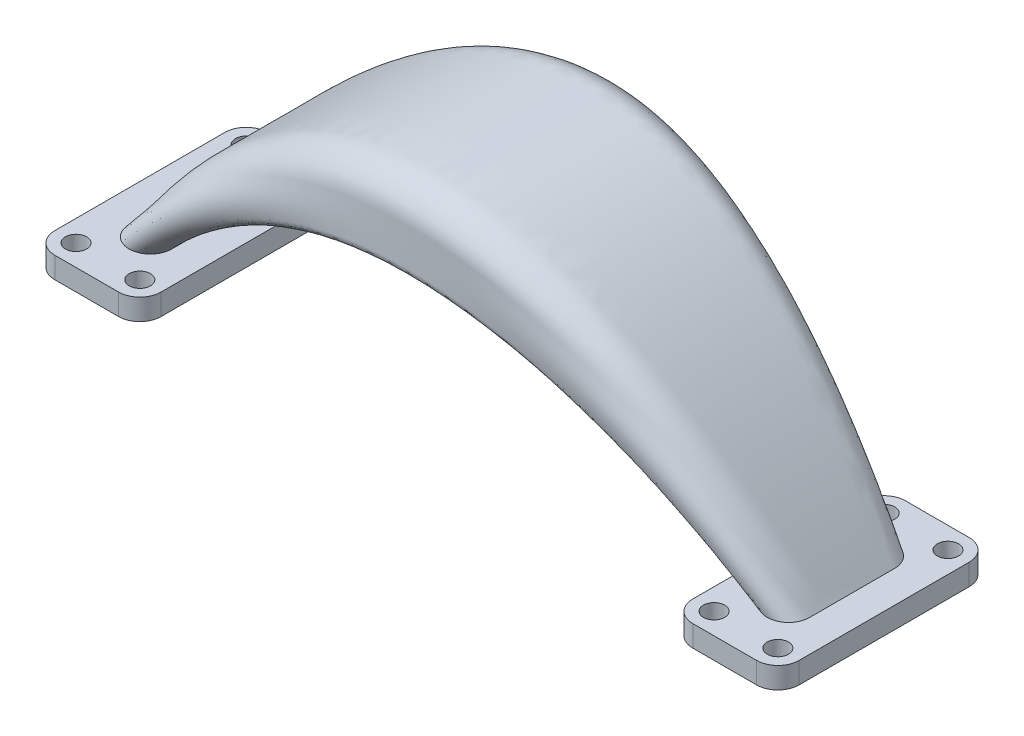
ISO-10303-21;
HEADER;
FILE_DESCRIPTION(('STEP AP214'),'2;1');
FILE_NAME('part.step','',(''),(''),'','','');
FILE_SCHEMA(('AUTOMOTIVE_DESIGN { 1 0 10303 214 1 1 1 1 }'));
ENDSEC;
DATA;
#1=APPLICATION_CONTEXT('core data for automotive mechanical design processes');
#2=APPLICATION_PROTOCOL_DEFINITION('international standard','automotive_design',2000,#1);
#3=PRODUCT_CONTEXT('',#1,'mechanical');
#4=PRODUCT('Part','Part','',(#3));
#5=PRODUCT_RELATED_PRODUCT_CATEGORY('part','',(#4));
#6=PRODUCT_DEFINITION_FORMATION('','',#4);
#7=PRODUCT_DEFINITION_CONTEXT('part definition',#1,'design');
#8=PRODUCT_DEFINITION('design','',#6,#7);
#9=PRODUCT_DEFINITION_SHAPE('','',#8);
#10=(LENGTH_UNIT() NAMED_UNIT(*) SI_UNIT(.MILLI.,.METRE.));
#11=(NAMED_UNIT(*) PLANE_ANGLE_UNIT() SI_UNIT($,.RADIAN.));
#12=(NAMED_UNIT(*) SI_UNIT($,.STERADIAN.) SOLID_ANGLE_UNIT());
#13=UNCERTAINTY_MEASURE_WITH_UNIT(LENGTH_MEASURE(1.E-05),#10,'distance_accuracy_value','');
#14=(GEOMETRIC_REPRESENTATION_CONTEXT(3) GLOBAL_UNCERTAINTY_ASSIGNED_CONTEXT((#13)) GLOBAL_UNIT_ASSIGNED_CONTEXT((#10,
#11,#12)) REPRESENTATION_CONTEXT('',''));
#15=CARTESIAN_POINT('',(0.,0.,0.));
#16=DIRECTION('',(0.,0.,1.));
#17=DIRECTION('',(1.,0.,0.));
#18=AXIS2_PLACEMENT_3D('',#15,#16,#17);
#19=CARTESIAN_POINT('',(33.,-2.,-8.));
#20=DIRECTION('',(0.,1.,0.));
#21=DIRECTION('',(0.,0.,1.));
#22=AXIS2_PLACEMENT_3D('',#19,#20,#21);
#23=CYLINDRICAL_SURFACE('',#22,2.);
#24=CARTESIAN_POINT('',(33.,0.,-8.));
#25=DIRECTION('',(0.,-1.,0.));
#26=DIRECTION('',(0.,0.,1.));
#27=AXIS2_PLACEMENT_3D('',#24,#25,#26);
#28=CIRCLE('',#27,2.);
#29=CARTESIAN_POINT('',(33.,0.,-10.));
#30=VERTEX_POINT('',#29);
#31=CARTESIAN_POINT('',(35.,0.,-7.99999999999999));
#32=VERTEX_POINT('',#31);
#33=EDGE_CURVE('E549',#30,#32,#28,.T.);
#34=ORIENTED_EDGE('',*,*,#33,.T.);
#35=DIRECTION('',(0.,1.,0.));
#36=VECTOR('',#35,1.);
#37=CARTESIAN_POINT('',(35.,-2.,-7.99999999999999));
#38=LINE('',#37,#36);
#39=CARTESIAN_POINT('',(35.,-2.,-7.99999999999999));
#40=VERTEX_POINT('',#39);
#41=EDGE_CURVE('E508',#40,#32,#38,.T.);
#42=ORIENTED_EDGE('',*,*,#41,.F.);
#43=CARTESIAN_POINT('',(33.,-2.,-8.));
#44=DIRECTION('',(0.,-1.,0.));
#45=DIRECTION('',(0.,0.,1.));
#46=AXIS2_PLACEMENT_3D('',#43,#44,#45);
#47=CIRCLE('',#46,2.);
#48=CARTESIAN_POINT('',(33.,-2.,-10.));
#49=VERTEX_POINT('',#48);
#50=EDGE_CURVE('E537',#49,#40,#47,.T.);
#51=ORIENTED_EDGE('',*,*,#50,.F.);
#52=DIRECTION('',(0.,1.,0.));
#53=VECTOR('',#52,1.);
#54=CARTESIAN_POINT('',(33.,-2.,-10.));
#55=LINE('',#54,#53);
#56=EDGE_CURVE('E530',#49,#30,#55,.T.);
#57=ORIENTED_EDGE('',*,*,#56,.T.);
#58=EDGE_LOOP('',(#34,#42,#51,#57));
#59=FACE_BOUND('',#58,.T.);
#60=ADVANCED_FACE('F334',(#59),#23,.T.);
#61=CARTESIAN_POINT('',(35.,-2.,7.99999999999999));
#62=DIRECTION('',(-1.,0.,0.));
#63=DIRECTION('',(0.,0.,1.));
#64=AXIS2_PLACEMENT_3D('',#61,#62,#63);
#65=PLANE('',#64);
#66=DIRECTION('',(0.,0.,1.));
#67=VECTOR('',#66,1.);
#68=CARTESIAN_POINT('',(35.,0.,7.99999999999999));
#69=LINE('',#68,#67);
#70=CARTESIAN_POINT('',(35.,0.,7.99999999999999));
#71=VERTEX_POINT('',#70);
#72=EDGE_CURVE('E547',#32,#71,#69,.T.);
#73=ORIENTED_EDGE('',*,*,#72,.T.);
#74=DIRECTION('',(0.,1.,0.));
#75=VECTOR('',#74,1.);
#76=CARTESIAN_POINT('',(35.,-2.,7.99999999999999));
#77=LINE('',#76,#75);
#78=CARTESIAN_POINT('',(35.,-2.,7.99999999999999));
#79=VERTEX_POINT('',#78);
#80=EDGE_CURVE('E511',#79,#71,#77,.T.);
#81=ORIENTED_EDGE('',*,*,#80,.F.);
#82=DIRECTION('',(0.,0.,1.));
#83=VECTOR('',#82,1.);
#84=CARTESIAN_POINT('',(35.,-2.,7.99999999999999));
#85=LINE('',#84,#83);
#86=EDGE_CURVE('E563',#40,#79,#85,.T.);
#87=ORIENTED_EDGE('',*,*,#86,.F.);
#88=ORIENTED_EDGE('',*,*,#41,.T.);
#89=EDGE_LOOP('',(#73,#81,#87,#88));
#90=FACE_BOUND('',#89,.T.);
#91=ADVANCED_FACE('F785',(#90),#65,.F.);
#92=CARTESIAN_POINT('',(33.,-2.,8.));
#93=DIRECTION('',(0.,1.,0.));
#94=DIRECTION('',(0.,0.,1.));
#95=AXIS2_PLACEMENT_3D('',#92,#93,#94);
#96=CYLINDRICAL_SURFACE('',#95,2.);
#97=CARTESIAN_POINT('',(33.,0.,8.));
#98=DIRECTION('',(0.,-1.,0.));
#99=DIRECTION('',(0.,0.,1.));
#100=AXIS2_PLACEMENT_3D('',#97,#98,#99);
#101=CIRCLE('',#100,2.);
#102=CARTESIAN_POINT('',(33.,0.,10.));
#103=VERTEX_POINT('',#102);
#104=EDGE_CURVE('E545',#71,#103,#101,.T.);
#105=ORIENTED_EDGE('',*,*,#104,.T.);
#106=DIRECTION('',(0.,1.,0.));
#107=VECTOR('',#106,1.);
#108=CARTESIAN_POINT('',(33.,-2.,10.));
#109=LINE('',#108,#107);
#110=CARTESIAN_POINT('',(33.,-2.,10.));
#111=VERTEX_POINT('',#110);
#112=EDGE_CURVE('E515',#111,#103,#109,.T.);
#113=ORIENTED_EDGE('',*,*,#112,.F.);
#114=CARTESIAN_POINT('',(33.,-2.,8.));
#115=DIRECTION('',(0.,-1.,0.));
#116=DIRECTION('',(0.,0.,1.));
#117=AXIS2_PLACEMENT_3D('',#114,#115,#116);
#118=CIRCLE('',#117,2.);
#119=EDGE_CURVE('E561',#79,#111,#118,.T.);
#120=ORIENTED_EDGE('',*,*,#119,.F.);
#121=ORIENTED_EDGE('',*,*,#80,.T.);
#122=EDGE_LOOP('',(#105,#113,#120,#121));
#123=FACE_BOUND('',#122,.T.);
#124=ADVANCED_FACE('F781',(#123),#96,.T.);
#125=CARTESIAN_POINT('',(33.,-2.,10.));
#126=DIRECTION('',(0.,0.,-1.));
#127=DIRECTION('',(-1.,0.,0.));
#128=AXIS2_PLACEMENT_3D('',#125,#126,#127);
#129=PLANE('',#128);
#130=DIRECTION('',(-1.,0.,0.));
#131=VECTOR('',#130,1.);
#132=CARTESIAN_POINT('',(33.,0.,10.));
#133=LINE('',#132,#131);
#134=CARTESIAN_POINT('',(27.,0.,10.));
#135=VERTEX_POINT('',#134);
#136=EDGE_CURVE('E543',#103,#135,#133,.T.);
#137=ORIENTED_EDGE('',*,*,#136,.T.);
#138=DIRECTION('',(0.,1.,0.));
#139=VECTOR('',#138,1.);
#140=CARTESIAN_POINT('',(27.,-2.,10.));
#141=LINE('',#140,#139);
#142=CARTESIAN_POINT('',(27.,-2.,10.));
#143=VERTEX_POINT('',#142);
#144=EDGE_CURVE('E518',#143,#135,#141,.T.);
#145=ORIENTED_EDGE('',*,*,#144,.F.);
#146=DIRECTION('',(-1.,0.,0.));
#147=VECTOR('',#146,1.);
#148=CARTESIAN_POINT('',(33.,-2.,10.));
#149=LINE('',#148,#147);
#150=EDGE_CURVE('E559',#111,#143,#149,.T.);
#151=ORIENTED_EDGE('',*,*,#150,.F.);
#152=ORIENTED_EDGE('',*,*,#112,.T.);
#153=EDGE_LOOP('',(#137,#145,#151,#152));
#154=FACE_BOUND('',#153,.T.);
#155=ADVANCED_FACE('F778',(#154),#129,.F.);
#156=CARTESIAN_POINT('',(27.,-2.,8.));
#157=DIRECTION('',(0.,1.,0.));
#158=DIRECTION('',(0.,0.,1.));
#159=AXIS2_PLACEMENT_3D('',#156,#157,#158);
#160=CYLINDRICAL_SURFACE('',#159,2.);
#161=CARTESIAN_POINT('',(27.,0.,8.));
#162=DIRECTION('',(0.,-1.,0.));
#163=DIRECTION('',(0.,0.,-1.));
#164=AXIS2_PLACEMENT_3D('',#161,#162,#163);
#165=CIRCLE('',#164,2.);
#166=CARTESIAN_POINT('',(25.,0.,7.99999999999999));
#167=VERTEX_POINT('',#166);
#168=EDGE_CURVE('E541',#135,#167,#165,.T.);
#169=ORIENTED_EDGE('',*,*,#168,.T.);
#170=DIRECTION('',(0.,1.,0.));
#171=VECTOR('',#170,1.);
#172=CARTESIAN_POINT('',(25.,-2.,7.99999999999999));
#173=LINE('',#172,#171);
#174=CARTESIAN_POINT('',(25.,-2.,7.99999999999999));
#175=VERTEX_POINT('',#174);
#176=EDGE_CURVE('E521',#175,#167,#173,.T.);
#177=ORIENTED_EDGE('',*,*,#176,.F.);
#178=CARTESIAN_POINT('',(27.,-2.,8.));
#179=DIRECTION('',(0.,-1.,0.));
#180=DIRECTION('',(0.,0.,-1.));
#181=AXIS2_PLACEMENT_3D('',#178,#179,#180);
#182=CIRCLE('',#181,2.);
#183=EDGE_CURVE('E557',#143,#175,#182,.T.);
#184=ORIENTED_EDGE('',*,*,#183,.F.);
#185=ORIENTED_EDGE('',*,*,#144,.T.);
#186=EDGE_LOOP('',(#169,#177,#184,#185));
#187=FACE_BOUND('',#186,.T.);
#188=ADVANCED_FACE('F774',(#187),#160,.T.);
#189=CARTESIAN_POINT('',(25.,-2.,7.99999999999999));
#190=DIRECTION('',(1.,0.,0.));
#191=DIRECTION('',(0.,0.,-1.));
#192=AXIS2_PLACEMENT_3D('',#189,#190,#191);
#193=PLANE('',#192);
#194=DIRECTION('',(0.,0.,-1.));
#195=VECTOR('',#194,1.);
#196=CARTESIAN_POINT('',(25.,0.,7.99999999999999));
#197=LINE('',#196,#195);
#198=CARTESIAN_POINT('',(25.,0.,-7.99999999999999));
#199=VERTEX_POINT('',#198);
#200=EDGE_CURVE('E539',#167,#199,#197,.T.);
#201=ORIENTED_EDGE('',*,*,#200,.T.);
#202=DIRECTION('',(0.,1.,0.));
#203=VECTOR('',#202,1.);
#204=CARTESIAN_POINT('',(25.,-2.,-7.99999999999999));
#205=LINE('',#204,#203);
#206=CARTESIAN_POINT('',(25.,-2.,-7.99999999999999));
#207=VERTEX_POINT('',#206);
#208=EDGE_CURVE('E524',#207,#199,#205,.T.);
#209=ORIENTED_EDGE('',*,*,#208,.F.);
#210=DIRECTION('',(0.,0.,-1.));
#211=VECTOR('',#210,1.);
#212=CARTESIAN_POINT('',(25.,-2.,7.99999999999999));
#213=LINE('',#212,#211);
#214=EDGE_CURVE('E555',#175,#207,#213,.T.);
#215=ORIENTED_EDGE('',*,*,#214,.F.);
#216=ORIENTED_EDGE('',*,*,#176,.T.);
#217=EDGE_LOOP('',(#201,#209,#215,#216));
#218=FACE_BOUND('',#217,.T.);
#219=ADVANCED_FACE('F769',(#218),#193,.F.);
#220=CARTESIAN_POINT('',(27.,-2.,-8.));
#221=DIRECTION('',(0.,1.,0.));
#222=DIRECTION('',(0.,0.,1.));
#223=AXIS2_PLACEMENT_3D('',#220,#221,#222);
#224=CYLINDRICAL_SURFACE('',#223,2.);
#225=CARTESIAN_POINT('',(27.,0.,-8.));
#226=DIRECTION('',(0.,-1.,0.));
#227=DIRECTION('',(0.,0.,-1.));
#228=AXIS2_PLACEMENT_3D('',#225,#226,#227);
#229=CIRCLE('',#228,2.);
#230=CARTESIAN_POINT('',(27.,0.,-10.));
#231=VERTEX_POINT('',#230);
#232=EDGE_CURVE('E536',#199,#231,#229,.T.);
#233=ORIENTED_EDGE('',*,*,#232,.T.);
#234=DIRECTION('',(0.,1.,0.));
#235=VECTOR('',#234,1.);
#236=CARTESIAN_POINT('',(27.,-2.,-10.));
#237=LINE('',#236,#235);
#238=CARTESIAN_POINT('',(27.,-2.,-10.));
#239=VERTEX_POINT('',#238);
#240=EDGE_CURVE('E527',#239,#231,#237,.T.);
#241=ORIENTED_EDGE('',*,*,#240,.F.);
#242=CARTESIAN_POINT('',(27.,-2.,-8.));
#243=DIRECTION('',(0.,-1.,0.));
#244=DIRECTION('',(0.,0.,-1.));
#245=AXIS2_PLACEMENT_3D('',#242,#243,#244);
#246=CIRCLE('',#245,2.);
#247=EDGE_CURVE('E553',#207,#239,#246,.T.);
#248=ORIENTED_EDGE('',*,*,#247,.F.);
#249=ORIENTED_EDGE('',*,*,#208,.T.);
#250=EDGE_LOOP('',(#233,#241,#248,#249));
#251=FACE_BOUND('',#250,.T.);
#252=ADVANCED_FACE('F763',(#251),#224,.T.);
#253=CARTESIAN_POINT('',(33.,-2.,-10.));
#254=DIRECTION('',(0.,0.,1.));
#255=DIRECTION('',(1.,0.,0.));
#256=AXIS2_PLACEMENT_3D('',#253,#254,#255);
#257=PLANE('',#256);
#258=DIRECTION('',(1.,0.,0.));
#259=VECTOR('',#258,1.);
#260=CARTESIAN_POINT('',(33.,0.,-10.));
#261=LINE('',#260,#259);
#262=EDGE_CURVE('E534',#231,#30,#261,.T.);
#263=ORIENTED_EDGE('',*,*,#262,.T.);
#264=ORIENTED_EDGE('',*,*,#56,.F.);
#265=DIRECTION('',(1.,0.,0.));
#266=VECTOR('',#265,1.);
#267=CARTESIAN_POINT('',(33.,-2.,-10.));
#268=LINE('',#267,#266);
#269=EDGE_CURVE('E533',#239,#49,#268,.T.);
#270=ORIENTED_EDGE('',*,*,#269,.F.);
#271=ORIENTED_EDGE('',*,*,#240,.T.);
#272=EDGE_LOOP('',(#263,#264,#270,#271));
#273=FACE_BOUND('',#272,.T.);
#274=ADVANCED_FACE('F586',(#273),#257,.F.);
#275=CARTESIAN_POINT('',(33.,-2.,-8.));
#276=DIRECTION('',(0.,1.,0.));
#277=DIRECTION('',(0.,0.,1.));
#278=AXIS2_PLACEMENT_3D('',#275,#276,#277);
#279=PLANE('',#278);
#280=CARTESIAN_POINT('',(33.,-2.,8.));
#281=DIRECTION('',(0.,1.,0.));
#282=DIRECTION('',(0.,0.,-1.));
#283=AXIS2_PLACEMENT_3D('',#280,#281,#282);
#284=CIRCLE('',#283,0.999999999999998);
#285=CARTESIAN_POINT('',(33.,-2.,7.));
#286=VERTEX_POINT('',#285);
#287=EDGE_CURVE('E988',#286,#286,#284,.T.);
#288=ORIENTED_EDGE('',*,*,#287,.T.);
#289=EDGE_LOOP('',(#288));
#290=FACE_BOUND('',#289,.T.);
#291=CARTESIAN_POINT('',(27.,-2.,8.));
#292=DIRECTION('',(0.,1.,0.));
#293=DIRECTION('',(0.,0.,-1.));
#294=AXIS2_PLACEMENT_3D('',#291,#292,#293);
#295=CIRCLE('',#294,1.);
#296=CARTESIAN_POINT('',(27.,-2.,7.));
#297=VERTEX_POINT('',#296);
#298=EDGE_CURVE('E1094',#297,#297,#295,.T.);
#299=ORIENTED_EDGE('',*,*,#298,.T.);
#300=EDGE_LOOP('',(#299));
#301=FACE_BOUND('',#300,.T.);
#302=CARTESIAN_POINT('',(27.,-2.,-8.));
#303=DIRECTION('',(0.,1.,0.));
#304=DIRECTION('',(0.,0.,-1.));
#305=AXIS2_PLACEMENT_3D('',#302,#303,#304);
#306=CIRCLE('',#305,1.);
#307=CARTESIAN_POINT('',(27.,-2.,-9.));
#308=VERTEX_POINT('',#307);
#309=EDGE_CURVE('E1088',#308,#308,#306,.T.);
#310=ORIENTED_EDGE('',*,*,#309,.T.);
#311=EDGE_LOOP('',(#310));
#312=FACE_BOUND('',#311,.T.);
#313=CARTESIAN_POINT('',(33.,-2.,-8.));
#314=DIRECTION('',(0.,1.,0.));
#315=DIRECTION('',(0.,0.,-1.));
#316=AXIS2_PLACEMENT_3D('',#313,#314,#315);
#317=CIRCLE('',#316,0.999999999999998);
#318=CARTESIAN_POINT('',(33.,-2.,-9.));
#319=VERTEX_POINT('',#318);
#320=EDGE_CURVE('E1082',#319,#319,#317,.T.);
#321=ORIENTED_EDGE('',*,*,#320,.T.);
#322=EDGE_LOOP('',(#321));
#323=FACE_BOUND('',#322,.T.);
#324=ORIENTED_EDGE('',*,*,#50,.T.);
#325=ORIENTED_EDGE('',*,*,#86,.T.);
#326=ORIENTED_EDGE('',*,*,#119,.T.);
#327=ORIENTED_EDGE('',*,*,#150,.T.);
#328=ORIENTED_EDGE('',*,*,#183,.T.);
#329=ORIENTED_EDGE('',*,*,#214,.T.);
#330=ORIENTED_EDGE('',*,*,#247,.T.);
#331=ORIENTED_EDGE('',*,*,#269,.T.);
#332=EDGE_LOOP('',(#324,#325,#326,#327,#328,#329,#330,#331));
#333=FACE_BOUND('',#332,.T.);
#334=ADVANCED_FACE('F584',(#290,#301,#312,#323,#333),#279,.F.);
#335=CARTESIAN_POINT('',(33.,0.,-8.));
#336=DIRECTION('',(0.,1.,0.));
#337=DIRECTION('',(0.,0.,1.));
#338=AXIS2_PLACEMENT_3D('',#335,#336,#337);
#339=PLANE('',#338);
#340=CARTESIAN_POINT('',(33.,0.,8.));
#341=DIRECTION('',(0.,1.,0.));
#342=DIRECTION('',(0.,0.,-1.));
#343=AXIS2_PLACEMENT_3D('',#340,#341,#342);
#344=CIRCLE('',#343,0.999999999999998);
#345=CARTESIAN_POINT('',(33.,0.,7.));
#346=VERTEX_POINT('',#345);
#347=EDGE_CURVE('E991',#346,#346,#344,.T.);
#348=ORIENTED_EDGE('',*,*,#347,.F.);
#349=EDGE_LOOP('',(#348));
#350=FACE_BOUND('',#349,.T.);
#351=CARTESIAN_POINT('',(27.,0.,8.));
#352=DIRECTION('',(0.,1.,0.));
#353=DIRECTION('',(0.,0.,-1.));
#354=AXIS2_PLACEMENT_3D('',#351,#352,#353);
#355=CIRCLE('',#354,1.);
#356=CARTESIAN_POINT('',(27.,0.,7.));
#357=VERTEX_POINT('',#356);
#358=EDGE_CURVE('E997',#357,#357,#355,.T.);
#359=ORIENTED_EDGE('',*,*,#358,.F.);
#360=EDGE_LOOP('',(#359));
#361=FACE_BOUND('',#360,.T.);
#362=CARTESIAN_POINT('',(27.,0.,-8.));
#363=DIRECTION('',(0.,1.,0.));
#364=DIRECTION('',(0.,0.,-1.));
#365=AXIS2_PLACEMENT_3D('',#362,#363,#364);
#366=CIRCLE('',#365,1.);
#367=CARTESIAN_POINT('',(27.,0.,-9.));
#368=VERTEX_POINT('',#367);
#369=EDGE_CURVE('E1091',#368,#368,#366,.T.);
#370=ORIENTED_EDGE('',*,*,#369,.F.);
#371=EDGE_LOOP('',(#370));
#372=FACE_BOUND('',#371,.T.);
#373=CARTESIAN_POINT('',(33.,0.,-8.));
#374=DIRECTION('',(0.,1.,0.));
#375=DIRECTION('',(0.,0.,-1.));
#376=AXIS2_PLACEMENT_3D('',#373,#374,#375);
#377=CIRCLE('',#376,0.999999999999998);
#378=CARTESIAN_POINT('',(33.,0.,-9.));
#379=VERTEX_POINT('',#378);
#380=EDGE_CURVE('E1085',#379,#379,#377,.T.);
#381=ORIENTED_EDGE('',*,*,#380,.F.);
#382=EDGE_LOOP('',(#381));
#383=FACE_BOUND('',#382,.T.);
#384=CARTESIAN_POINT('',(30.,0.,-4.));
#385=DIRECTION('',(0.,-1.,0.));
#386=DIRECTION('',(0.,0.,-1.));
#387=AXIS2_PLACEMENT_3D('',#384,#385,#386);
#388=CIRCLE('',#387,2.);
#389=CARTESIAN_POINT('',(28.,0.,-4.));
#390=VERTEX_POINT('',#389);
#391=CARTESIAN_POINT('',(32.,0.,-3.99999999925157));
#392=VERTEX_POINT('',#391);
#393=EDGE_CURVE('E354',#390,#392,#388,.T.);
#394=ORIENTED_EDGE('',*,*,#393,.T.);
#395=DIRECTION('',(0.,0.,1.));
#396=VECTOR('',#395,1.);
#397=CARTESIAN_POINT('',(32.,0.,-4.));
#398=LINE('',#397,#396);
#399=CARTESIAN_POINT('',(32.,0.,4.00000000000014));
#400=VERTEX_POINT('',#399);
#401=EDGE_CURVE('E604',#392,#400,#398,.T.);
#402=ORIENTED_EDGE('',*,*,#401,.T.);
#403=CARTESIAN_POINT('',(30.,0.,4.));
#404=DIRECTION('',(0.,-1.,0.));
#405=DIRECTION('',(0.,0.,-1.));
#406=AXIS2_PLACEMENT_3D('',#403,#404,#405);
#407=CIRCLE('',#406,2.);
#408=CARTESIAN_POINT('',(28.,0.,4.));
#409=VERTEX_POINT('',#408);
#410=EDGE_CURVE('E347',#400,#409,#407,.T.);
#411=ORIENTED_EDGE('',*,*,#410,.T.);
#412=DIRECTION('',(0.,0.,1.));
#413=VECTOR('',#412,1.);
#414=CARTESIAN_POINT('',(28.,0.,-4.));
#415=LINE('',#414,#413);
#416=EDGE_CURVE('E12',#390,#409,#415,.T.);
#417=ORIENTED_EDGE('',*,*,#416,.F.);
#418=EDGE_LOOP('',(#394,#402,#411,#417));
#419=FACE_BOUND('',#418,.T.);
#420=ORIENTED_EDGE('',*,*,#33,.F.);
#421=ORIENTED_EDGE('',*,*,#262,.F.);
#422=ORIENTED_EDGE('',*,*,#232,.F.);
#423=ORIENTED_EDGE('',*,*,#200,.F.);
#424=ORIENTED_EDGE('',*,*,#168,.F.);
#425=ORIENTED_EDGE('',*,*,#136,.F.);
#426=ORIENTED_EDGE('',*,*,#104,.F.);
#427=ORIENTED_EDGE('',*,*,#72,.F.);
#428=EDGE_LOOP('',(#420,#421,#422,#423,#424,#425,#426,#427));
#429=FACE_BOUND('',#428,.T.);
#430=ADVANCED_FACE('F575',(#350,#361,#372,#383,#419,#429),#339,.T.);
#431=CARTESIAN_POINT('',(-32.,0.,-3.99999999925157));
#432=CARTESIAN_POINT('',(-21.3333333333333,14.6666666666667,-5.9999999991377));
#433=CARTESIAN_POINT('',(0.,29.3333333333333,-7.99999999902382));
#434=CARTESIAN_POINT('',(21.3333333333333,14.6666666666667,-5.99999999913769));
#435=CARTESIAN_POINT('',(32.,0.,-3.99999999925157));
#436=CARTESIAN_POINT('',(-32.,0.,-3.41098214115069));
#437=CARTESIAN_POINT('',(-21.3252974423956,14.688557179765,-5.25990037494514));
#438=CARTESIAN_POINT('',(0.,29.311442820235,-6.96560969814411));
#439=CARTESIAN_POINT('',(21.3252974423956,14.688557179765,-5.25990037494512));
#440=CARTESIAN_POINT('',(32.,0.,-3.41098214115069));
#441=CARTESIAN_POINT('',(-32.,0.,-2.32633519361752));
#442=CARTESIAN_POINT('',(-21.3370638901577,14.6551971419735,-3.53853366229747));
#443=CARTESIAN_POINT('',(0.,29.3448028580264,-4.82166956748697));
#444=CARTESIAN_POINT('',(21.3370638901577,14.6551971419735,-3.53853366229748));
#445=CARTESIAN_POINT('',(32.,0.,-2.32633519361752));
#446=CARTESIAN_POINT('',(-32.,0.,-0.817625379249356));
#447=CARTESIAN_POINT('',(-21.3323302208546,14.6739742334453,-0.750370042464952));
#448=CARTESIAN_POINT('',(0.,29.3260257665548,-0.649647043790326));
#449=CARTESIAN_POINT('',(21.3323302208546,14.6739742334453,-0.750370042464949));
#450=CARTESIAN_POINT('',(32.,0.,-0.817625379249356));
#451=CARTESIAN_POINT('',(-32.,0.,0.646520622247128));
#452=CARTESIAN_POINT('',(-21.3336152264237,14.6489059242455,2.40697262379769));
#453=CARTESIAN_POINT('',(0.,29.3510940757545,4.10449141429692));
#454=CARTESIAN_POINT('',(21.3336152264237,14.6489059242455,2.40697262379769));
#455=CARTESIAN_POINT('',(32.,0.,0.646520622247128));
#456=CARTESIAN_POINT('',(-32.,0.,1.63288979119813));
#457=CARTESIAN_POINT('',(-21.3333443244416,14.7032366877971,4.37952105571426));
#458=CARTESIAN_POINT('',(0.,29.2967633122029,7.2506847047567));
#459=CARTESIAN_POINT('',(21.3333443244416,14.7032366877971,4.37952105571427));
#460=CARTESIAN_POINT('',(32.,0.,1.63288979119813));
#461=CARTESIAN_POINT('',(-32.,0.,2.21950924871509));
#462=CARTESIAN_POINT('',(-21.3333315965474,14.660887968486,5.53788538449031));
#463=CARTESIAN_POINT('',(0.,29.339112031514,8.83658324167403));
#464=CARTESIAN_POINT('',(21.3333315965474,14.660887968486,5.53788538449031));
#465=CARTESIAN_POINT('',(32.,0.,2.21950924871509));
#466=CARTESIAN_POINT('',(-32.,0.,2.37436104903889));
#467=CARTESIAN_POINT('',(-21.3333343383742,14.6461476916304,5.84880402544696));
#468=CARTESIAN_POINT('',(0.,29.2842492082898,9.33237748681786));
#469=CARTESIAN_POINT('',(21.3333343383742,14.6461476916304,5.84880402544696));
#470=CARTESIAN_POINT('',(32.,0.,2.37436104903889));
#471=CARTESIAN_POINT('',(-32.,0.,2.59656346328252));
#472=CARTESIAN_POINT('',(-21.3333324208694,14.5043428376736,6.36926260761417));
#473=CARTESIAN_POINT('',(0.,29.0108431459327,10.1395224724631));
#474=CARTESIAN_POINT('',(21.3333324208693,14.5043428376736,6.36926260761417));
#475=CARTESIAN_POINT('',(32.,0.,2.59656346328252));
#476=CARTESIAN_POINT('',(-32.,0.,2.81434315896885));
#477=CARTESIAN_POINT('',(-21.3333359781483,14.2472842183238,6.8625662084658));
#478=CARTESIAN_POINT('',(0.,28.4939847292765,10.9114158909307));
#479=CARTESIAN_POINT('',(21.3333359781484,14.2472842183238,6.8625662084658));
#480=CARTESIAN_POINT('',(32.,0.,2.81434315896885));
#481=CARTESIAN_POINT('',(-32.,0.,3.03176966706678));
#482=CARTESIAN_POINT('',(-21.3333236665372,13.9107643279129,7.2638773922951));
#483=CARTESIAN_POINT('',(0.,27.8217060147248,11.4959178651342));
#484=CARTESIAN_POINT('',(21.3333236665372,13.9107643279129,7.2638773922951));
#485=CARTESIAN_POINT('',(32.,0.,3.03176966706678));
#486=CARTESIAN_POINT('',(-32.,0.,3.25291251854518));
#487=CARTESIAN_POINT('',(-21.3333693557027,13.55944387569,7.55422911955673));
#488=CARTESIAN_POINT('',(0.,27.118762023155,11.8551880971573));
#489=CARTESIAN_POINT('',(21.3333693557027,13.55944387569,7.55422911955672));
#490=CARTESIAN_POINT('',(32.,0.,3.25291251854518));
#491=CARTESIAN_POINT('',(-32.,0.,3.48203197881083));
#492=CARTESIAN_POINT('',(-21.3331989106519,13.2278871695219,7.75573336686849));
#493=CARTESIAN_POINT('',(0.,26.4560998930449,12.0309325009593));
#494=CARTESIAN_POINT('',(21.3331989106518,13.2278871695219,7.75573336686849));
#495=CARTESIAN_POINT('',(32.,0.,3.48203197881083));
#496=CARTESIAN_POINT('',(-32.,0.,3.72338831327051));
#497=CARTESIAN_POINT('',(-21.3338350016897,12.9287990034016,7.8992335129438));
#498=CARTESIAN_POINT('',(0.,25.8564215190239,12.0694453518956));
#499=CARTESIAN_POINT('',(21.3338350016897,12.9287990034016,7.8992335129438));
#500=CARTESIAN_POINT('',(32.,0.,3.72338831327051));
#501=CARTESIAN_POINT('',(-32.,0.,3.9029399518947));
#502=CARTESIAN_POINT('',(-21.332252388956,12.7496993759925,7.96359798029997));
#503=CARTESIAN_POINT('',(0.,25.5019268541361,12.0364020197));
#504=CARTESIAN_POINT('',(21.332252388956,12.7496993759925,7.96359798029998));
#505=CARTESIAN_POINT('',(32.,0.,3.9029399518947));
#506=CARTESIAN_POINT('',(-32.,0.,4.33384212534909));
#507=CARTESIAN_POINT('',(-21.3370512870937,12.3810721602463,8.12520628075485));
#508=CARTESIAN_POINT('',(0.,24.7534488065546,11.8747937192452));
#509=CARTESIAN_POINT('',(21.3370512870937,12.3810721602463,8.12520628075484));
#510=CARTESIAN_POINT('',(32.,0.,4.33384212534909));
#511=CARTESIAN_POINT('',(-31.8287320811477,0.,5.03766837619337));
#512=CARTESIAN_POINT('',(-21.2175184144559,11.9640836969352,8.33925337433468));
#513=CARTESIAN_POINT('',(0.,23.9315815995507,11.6607466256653));
#514=CARTESIAN_POINT('',(21.2175184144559,11.9640836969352,8.33925337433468));
#515=CARTESIAN_POINT('',(31.8287320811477,0.,5.03766837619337));
#516=CARTESIAN_POINT('',(-30.9922636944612,0.,5.86968534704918));
#517=CARTESIAN_POINT('',(-20.6616592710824,11.4125914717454,8.62556638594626));
#518=CARTESIAN_POINT('',(0.,22.8262764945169,11.3744336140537));
#519=CARTESIAN_POINT('',(20.6616592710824,11.4125914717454,8.62556638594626));
#520=CARTESIAN_POINT('',(30.9922636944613,0.,5.86968534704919));
#521=CARTESIAN_POINT('',(-29.7909785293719,0.,6.10753574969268));
#522=CARTESIAN_POINT('',(-19.8616880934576,10.8998657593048,8.6997962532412));
#523=CARTESIAN_POINT('',(0.,21.7919431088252,11.3002037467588));
#524=CARTESIAN_POINT('',(19.8616880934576,10.8998657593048,8.6997962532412));
#525=CARTESIAN_POINT('',(29.7909785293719,0.,6.10753574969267));
#526=CARTESIAN_POINT('',(-29.0546035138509,0.,5.80103530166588));
#527=CARTESIAN_POINT('',(-19.3672188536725,10.527026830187,8.60512302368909));
#528=CARTESIAN_POINT('',(0.,21.0714975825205,11.3948769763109));
#529=CARTESIAN_POINT('',(19.3672188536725,10.527026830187,8.60512302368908));
#530=CARTESIAN_POINT('',(29.0546035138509,0.,5.80103530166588));
#531=CARTESIAN_POINT('',(-28.703161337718,0.,5.52448198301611));
#532=CARTESIAN_POINT('',(-19.1359593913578,10.2934298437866,8.5071763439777));
#533=CARTESIAN_POINT('',(0.,20.5832660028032,11.4928236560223));
#534=CARTESIAN_POINT('',(19.1359593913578,10.2934298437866,8.50717634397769));
#535=CARTESIAN_POINT('',(28.703161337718,0.,5.52448198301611));
#536=CARTESIAN_POINT('',(-28.5831289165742,0.,5.41848307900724));
#537=CARTESIAN_POINT('',(-19.0551786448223,10.2130054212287,8.46577793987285));
#538=CARTESIAN_POINT('',(0.,20.4276789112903,11.5117017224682));
#539=CARTESIAN_POINT('',(19.0551786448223,10.2130054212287,8.46577793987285));
#540=CARTESIAN_POINT('',(28.5831289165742,0.,5.41848307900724));
#541=CARTESIAN_POINT('',(-28.4153272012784,0.,5.22984177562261));
#542=CARTESIAN_POINT('',(-18.9436159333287,10.104400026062,8.37255674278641));
#543=CARTESIAN_POINT('',(0.,20.208352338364,11.5156410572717));
#544=CARTESIAN_POINT('',(18.9436159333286,10.104400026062,8.37255674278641));
#545=CARTESIAN_POINT('',(28.4153272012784,0.,5.22984177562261));
#546=CARTESIAN_POINT('',(-28.2719123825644,0.,5.01646304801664));
#547=CARTESIAN_POINT('',(-18.8479243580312,10.0030332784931,8.25483952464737));
#548=CARTESIAN_POINT('',(0.,20.0061893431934,11.4931096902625));
#549=CARTESIAN_POINT('',(18.8479243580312,10.003033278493,8.25483952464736));
#550=CARTESIAN_POINT('',(28.2719123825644,0.,5.01646304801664));
#551=CARTESIAN_POINT('',(-28.1582293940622,0.,4.79293586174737));
#552=CARTESIAN_POINT('',(-18.7721573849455,9.91007835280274,8.11691063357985));
#553=CARTESIAN_POINT('',(0.,19.8201132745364,11.440941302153));
#554=CARTESIAN_POINT('',(18.7721573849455,9.91007835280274,8.11691063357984));
#555=CARTESIAN_POINT('',(28.1582293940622,0.,4.79293586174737));
#556=CARTESIAN_POINT('',(-28.0796231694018,0.,4.57384918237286));
#557=CARTESIAN_POINT('',(-18.7197481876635,9.82601342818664,7.96263130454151));
#558=CARTESIAN_POINT('',(0.,19.6520777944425,11.3512961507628));
#559=CARTESIAN_POINT('',(18.7197481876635,9.82601342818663,7.96263130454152));
#560=CARTESIAN_POINT('',(28.0796231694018,0.,4.57384918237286));
#561=CARTESIAN_POINT('',(-28.0385564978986,0.,4.40002109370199));
#562=CARTESIAN_POINT('',(-18.6923691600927,9.76472763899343,7.81961585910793));
#563=CARTESIAN_POINT('',(0.,19.5293301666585,11.23953541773));
#564=CARTESIAN_POINT('',(18.6923691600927,9.76472763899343,7.81961585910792));
#565=CARTESIAN_POINT('',(28.0385564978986,0.,4.40002109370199));
#566=CARTESIAN_POINT('',(-28.0174909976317,0.,4.26923134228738));
#567=CARTESIAN_POINT('',(-18.6783307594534,9.72264579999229,7.69386066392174));
#568=CARTESIAN_POINT('',(0.,19.4455066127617,11.1179288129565));
#569=CARTESIAN_POINT('',(18.6783307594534,9.72264579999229,7.69386066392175));
#570=CARTESIAN_POINT('',(28.0174909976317,0.,4.26923134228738));
#571=CARTESIAN_POINT('',(-28.0069820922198,0.,4.17523208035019));
#572=CARTESIAN_POINT('',(-18.6713082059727,9.69578444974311,7.5909464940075));
#573=CARTESIAN_POINT('',(0.,19.3907489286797,11.008802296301));
#574=CARTESIAN_POINT('',(18.6713082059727,9.69578444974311,7.5909464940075));
#575=CARTESIAN_POINT('',(28.0069820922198,0.,4.17523208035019));
#576=CARTESIAN_POINT('',(-28.0011597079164,0.,4.08528256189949));
#577=CARTESIAN_POINT('',(-18.6674891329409,9.67365995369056,7.47950787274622));
#578=CARTESIAN_POINT('',(0.,19.3503847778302,10.865728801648));
#579=CARTESIAN_POINT('',(18.6674891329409,9.67365995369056,7.47950787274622));
#580=CARTESIAN_POINT('',(28.0011597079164,0.,4.08528256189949));
#581=CARTESIAN_POINT('',(-28.,0.,4.02798717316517));
#582=CARTESIAN_POINT('',(-18.6665603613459,9.66886823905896,7.38203524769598));
#583=CARTESIAN_POINT('',(0.,19.331131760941,10.7533326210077));
#584=CARTESIAN_POINT('',(18.666560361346,9.66886823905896,7.38203524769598));
#585=CARTESIAN_POINT('',(28.,0.,4.02798717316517));
#586=CARTESIAN_POINT('',(-28.,0.,3.43757488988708));
#587=CARTESIAN_POINT('',(-18.6688029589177,9.62242427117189,6.35462857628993));
#588=CARTESIAN_POINT('',(1.09287578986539E-13,19.3775757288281,8.92504351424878));
#589=CARTESIAN_POINT('',(18.6688029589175,9.6224242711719,6.35462857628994));
#590=CARTESIAN_POINT('',(28.,0.,3.43757488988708));
#591=CARTESIAN_POINT('',(-28.,0.,2.35523552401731));
#592=CARTESIAN_POINT('',(-18.6656748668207,9.69086024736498,3.93402044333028));
#593=CARTESIAN_POINT('',(0.,19.309139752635,5.67666858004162));
#594=CARTESIAN_POINT('',(18.6656748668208,9.69086024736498,3.93402044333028));
#595=CARTESIAN_POINT('',(28.,0.,2.35523552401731));
#596=CARTESIAN_POINT('',(-28.,0.,0.797639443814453));
#597=CARTESIAN_POINT('',(-18.6669335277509,9.64835272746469,0.464647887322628));
#598=CARTESIAN_POINT('',(0.,19.3516472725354,0.0780931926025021));
#599=CARTESIAN_POINT('',(18.6669335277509,9.64835272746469,0.46464788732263));
#600=CARTESIAN_POINT('',(28.,0.,0.797639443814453));
#601=CARTESIAN_POINT('',(-28.,0.,-0.734544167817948));
#602=CARTESIAN_POINT('',(-18.6665910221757,9.71572884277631,-3.19944097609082));
#603=CARTESIAN_POINT('',(0.,19.2842711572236,-5.61394844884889));
#604=CARTESIAN_POINT('',(18.6665910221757,9.71572884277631,-3.19944097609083));
#605=CARTESIAN_POINT('',(28.,0.,-0.734544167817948));
#606=CARTESIAN_POINT('',(-28.,0.,-1.7624785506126));
#607=CARTESIAN_POINT('',(-18.6666652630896,9.56439754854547,-5.5557227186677));
#608=CARTESIAN_POINT('',(0.,19.4356024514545,-9.43083324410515));
#609=CARTESIAN_POINT('',(18.6666652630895,9.56439754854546,-5.55572271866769));
#610=CARTESIAN_POINT('',(28.,0.,-1.7624785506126));
#611=CARTESIAN_POINT('',(-28.,0.,-2.32731613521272));
#612=CARTESIAN_POINT('',(-18.6666667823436,9.67509525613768,-6.86080618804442));
#613=CARTESIAN_POINT('',(0.,19.3249047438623,-11.3875491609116));
#614=CARTESIAN_POINT('',(18.6666667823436,9.67509525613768,-6.86080618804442));
#615=CARTESIAN_POINT('',(28.,0.,-2.32731613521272));
#616=CARTESIAN_POINT('',(-28.,0.,-2.41058037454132));
#617=CARTESIAN_POINT('',(-18.6666665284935,9.69436962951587,-7.05706370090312));
#618=CARTESIAN_POINT('',(0.,19.3998215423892,-11.7059128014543));
#619=CARTESIAN_POINT('',(18.6666665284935,9.69436962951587,-7.05706370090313));
#620=CARTESIAN_POINT('',(28.,0.,-2.41058037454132));
#621=CARTESIAN_POINT('',(-28.,0.,-2.53183323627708));
#622=CARTESIAN_POINT('',(-18.6666669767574,9.84764751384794,-7.32639472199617));
#623=CARTESIAN_POINT('',(0.,19.6944356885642,-12.1227966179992));
#624=CARTESIAN_POINT('',(18.6666669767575,9.84764751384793,-7.32639472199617));
#625=CARTESIAN_POINT('',(28.,0.,-2.53183323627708));
#626=CARTESIAN_POINT('',(-28.,0.,-2.65281382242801));
#627=CARTESIAN_POINT('',(-18.6666655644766,10.0786566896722,-7.5219203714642));
#628=CARTESIAN_POINT('',(0.,20.1496684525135,-12.3812995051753));
#629=CARTESIAN_POINT('',(18.6666655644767,10.0786566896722,-7.5219203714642));
#630=CARTESIAN_POINT('',(28.,0.,-2.65281382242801));
#631=CARTESIAN_POINT('',(-28.,0.,-2.73549042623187));
#632=CARTESIAN_POINT('',(-18.6666690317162,10.2433365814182,-7.57134002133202));
#633=CARTESIAN_POINT('',(0.,20.505084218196,-12.428659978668));
#634=CARTESIAN_POINT('',(18.6666690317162,10.2433365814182,-7.57134002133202));
#635=CARTESIAN_POINT('',(28.,0.,-2.73549042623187));
#636=CARTESIAN_POINT('',(-28.,0.,-2.87846467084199));
#637=CARTESIAN_POINT('',(-18.6666610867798,10.54566364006,-7.64303997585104));
#638=CARTESIAN_POINT('',(0.,21.0478898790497,-12.356960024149));
#639=CARTESIAN_POINT('',(18.6666610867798,10.54566364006,-7.64303997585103));
#640=CARTESIAN_POINT('',(28.,0.,-2.87846467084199));
#641=CARTESIAN_POINT('',(-28.,0.,-3.06838539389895));
#642=CARTESIAN_POINT('',(-18.6666042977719,11.0555651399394,-7.68176405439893));
#643=CARTESIAN_POINT('',(0.,22.1310197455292,-12.3182359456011));
#644=CARTESIAN_POINT('',(18.6666042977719,11.0555651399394,-7.68176405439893));
#645=CARTESIAN_POINT('',(28.,0.,-3.06838539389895));
#646=CARTESIAN_POINT('',(-28.,0.,-3.34498764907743));
#647=CARTESIAN_POINT('',(-18.6668933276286,11.8803084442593,-7.7832770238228));
#648=CARTESIAN_POINT('',(0.,23.7561598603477,-12.2167229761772));
#649=CARTESIAN_POINT('',(18.6668933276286,11.8803084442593,-7.7832770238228));
#650=CARTESIAN_POINT('',(28.,0.,-3.34498764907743));
#651=CARTESIAN_POINT('',(-28.,0.,-3.63844756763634));
#652=CARTESIAN_POINT('',(-18.6658223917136,12.3247518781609,-7.88072236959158));
#653=CARTESIAN_POINT('',(0.,24.6474424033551,-12.1192776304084));
#654=CARTESIAN_POINT('',(18.6658223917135,12.3247518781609,-7.88072236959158));
#655=CARTESIAN_POINT('',(28.,0.,-3.63844756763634));
#656=CARTESIAN_POINT('',(-28.,0.,-3.85985849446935));
#657=CARTESIAN_POINT('',(-18.6684855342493,12.5618410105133,-7.94931687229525));
#658=CARTESIAN_POINT('',(0.,25.1314631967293,-12.0506831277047));
#659=CARTESIAN_POINT('',(18.6684855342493,12.5618410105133,-7.94931687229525));
#660=CARTESIAN_POINT('',(28.,0.,-3.85985849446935));
#661=CARTESIAN_POINT('',(-28.,0.,-4.24264317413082));
#662=CARTESIAN_POINT('',(-18.6635174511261,12.8481634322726,-8.08775355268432));
#663=CARTESIAN_POINT('',(0.,25.6828544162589,-11.9122464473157));
#664=CARTESIAN_POINT('',(18.6635174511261,12.8481634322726,-8.08775355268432));
#665=CARTESIAN_POINT('',(28.,0.,-4.24264317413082));
#666=CARTESIAN_POINT('',(-28.0893937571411,0.,-4.74634486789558));
#667=CARTESIAN_POINT('',(-18.7277240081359,13.1289038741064,-8.20343244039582));
#668=CARTESIAN_POINT('',(0.,26.2640598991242,-11.6700876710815));
#669=CARTESIAN_POINT('',(18.7277240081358,13.1289038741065,-8.20343244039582));
#670=CARTESIAN_POINT('',(28.0893937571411,0.,-4.74634486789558));
#671=CARTESIAN_POINT('',(-28.5272899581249,0.,-5.43609628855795));
#672=CARTESIAN_POINT('',(-19.0178018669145,13.4873556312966,-8.31577966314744));
#673=CARTESIAN_POINT('',(0.,26.9730374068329,-11.1929024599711));
#674=CARTESIAN_POINT('',(19.0178018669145,13.4873556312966,-8.31577966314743));
#675=CARTESIAN_POINT('',(28.5272899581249,0.,-5.43609628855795));
#676=CARTESIAN_POINT('',(-29.2332998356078,0.,-5.91220939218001));
#677=CARTESIAN_POINT('',(-19.4889708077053,13.7877361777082,-8.30433950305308));
#678=CARTESIAN_POINT('',(0.,27.575915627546,-10.6971442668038));
#679=CARTESIAN_POINT('',(19.4889708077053,13.7877361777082,-8.30433950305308));
#680=CARTESIAN_POINT('',(29.2332998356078,0.,-5.91220939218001));
#681=CARTESIAN_POINT('',(-30.0840757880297,0.,-6.05830238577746));
#682=CARTESIAN_POINT('',(-20.0560249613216,14.0498594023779,-8.14387946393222));
#683=CARTESIAN_POINT('',(0.,28.0996195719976,-10.2293185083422));
#684=CARTESIAN_POINT('',(20.0560249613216,14.0498594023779,-8.14387946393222));
#685=CARTESIAN_POINT('',(30.0840757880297,0.,-6.05830238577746));
#686=CARTESIAN_POINT('',(-30.9055356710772,0.,-5.84617981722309));
#687=CARTESIAN_POINT('',(-20.6036884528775,14.2745086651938,-7.82093727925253));
#688=CARTESIAN_POINT('',(0.,28.5489709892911,-9.7955722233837));
#689=CARTESIAN_POINT('',(20.6036884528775,14.2745086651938,-7.82093727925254));
#690=CARTESIAN_POINT('',(30.9055356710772,0.,-5.84617981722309));
#691=CARTESIAN_POINT('',(-31.4389302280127,0.,-5.4305992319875));
#692=CARTESIAN_POINT('',(-20.9593144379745,14.4315693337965,-7.43188733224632));
#693=CARTESIAN_POINT('',(0.,28.8633681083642,-9.43367843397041));
#694=CARTESIAN_POINT('',(20.9593144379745,14.4315693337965,-7.43188733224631));
#695=CARTESIAN_POINT('',(31.4389302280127,0.,-5.4305992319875));
#696=CARTESIAN_POINT('',(-31.7351829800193,0.,-5.01750043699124));
#697=CARTESIAN_POINT('',(-21.1567393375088,14.5356623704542,-7.06060237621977));
#698=CARTESIAN_POINT('',(0.,29.0709210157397,-9.10282341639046));
#699=CARTESIAN_POINT('',(21.1567393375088,14.5356623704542,-7.06060237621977));
#700=CARTESIAN_POINT('',(31.7351829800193,0.,-5.01750043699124));
#701=CARTESIAN_POINT('',(-31.8914714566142,0.,-4.6829353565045));
#702=CARTESIAN_POINT('',(-21.2611698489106,14.6004713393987,-6.75100992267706));
#703=CARTESIAN_POINT('',(0.,29.2024864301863,-8.82245105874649));
#704=CARTESIAN_POINT('',(21.2611698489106,14.6004713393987,-6.75100992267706));
#705=CARTESIAN_POINT('',(31.8914714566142,0.,-4.6829353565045));
#706=CARTESIAN_POINT('',(-31.9811892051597,0.,-4.33920547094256));
#707=CARTESIAN_POINT('',(-21.3200866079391,14.6514627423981,-6.41304365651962));
#708=CARTESIAN_POINT('',(0.,29.2971542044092,-8.47429646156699));
#709=CARTESIAN_POINT('',(21.3200866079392,14.6514627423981,-6.41304365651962));
#710=CARTESIAN_POINT('',(31.9811892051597,0.,-4.33920547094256));
#711=CARTESIAN_POINT('',(-32.,0.,-4.11155068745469));
#712=CARTESIAN_POINT('',(-21.3348552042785,14.6625209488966,-6.14016318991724));
#713=CARTESIAN_POINT('',(0.,29.3374790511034,-8.19589720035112));
#714=CARTESIAN_POINT('',(21.3348552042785,14.6625209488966,-6.14016318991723));
#715=CARTESIAN_POINT('',(32.,0.,-4.11155068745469));
#716=CARTESIAN_POINT('',(-32.,0.,-3.99999999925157));
#717=CARTESIAN_POINT('',(-21.3333333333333,14.6666666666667,-5.9999999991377));
#718=CARTESIAN_POINT('',(0.,29.3333333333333,-7.99999999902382));
#719=CARTESIAN_POINT('',(21.3333333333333,14.6666666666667,-5.99999999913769));
#720=CARTESIAN_POINT('',(32.,0.,-3.99999999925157));
#721=B_SPLINE_SURFACE_WITH_KNOTS('',3,3,((#431,#432,#433,#434,#435),(#436,#437,#438,#439,#440),
(#441,#442,#443,#444,#445),(#446,#447,#448,#449,#450),(#451,#452,#453,#454,#455),(#456,#457,
#458,#459,#460),(#461,#462,#463,#464,#465),(#466,#467,#468,#469,#470),(#471,#472,#473,#474,
#475),(#476,#477,#478,#479,#480),(#481,#482,#483,#484,#485),(#486,#487,#488,#489,#490),(#491,
#492,#493,#494,#495),(#496,#497,#498,#499,#500),(#501,#502,#503,#504,#505),(#506,#507,#508,#509,
#510),(#511,#512,#513,#514,#515),(#516,#517,#518,#519,#520),(#521,#522,#523,#524,#525),(#526,
#527,#528,#529,#530),(#531,#532,#533,#534,#535),(#536,#537,#538,#539,#540),(#541,#542,#543,#544,
#545),(#546,#547,#548,#549,#550),(#551,#552,#553,#554,#555),(#556,#557,#558,#559,#560),(#561,
#562,#563,#564,#565),(#566,#567,#568,#569,#570),(#571,#572,#573,#574,#575),(#576,#577,#578,#579,
#580),(#581,#582,#583,#584,#585),(#586,#587,#588,#589,#590),(#591,#592,#593,#594,#595),(#596,
#597,#598,#599,#600),(#601,#602,#603,#604,#605),(#606,#607,#608,#609,#610),(#611,#612,#613,#614,
#615),(#616,#617,#618,#619,#620),(#621,#622,#623,#624,#625),(#626,#627,#628,#629,#630),(#631,
#632,#633,#634,#635),(#636,#637,#638,#639,#640),(#641,#642,#643,#644,#645),(#646,#647,#648,#649,
#650),(#651,#652,#653,#654,#655),(#656,#657,#658,#659,#660),(#661,#662,#663,#664,#665),(#666,
#667,#668,#669,#670),(#671,#672,#673,#674,#675),(#676,#677,#678,#679,#680),(#681,#682,#683,#684,
#685),(#686,#687,#688,#689,#690),(#691,#692,#693,#694,#695),(#696,#697,#698,#699,#700),(#701,
#702,#703,#704,#705),(#706,#707,#708,#709,#710),(#711,#712,#713,#714,#715),(#716,#717,#718,#719,
#720)),.UNSPECIFIED.,.T.,.F.,.F.,(4,1,1,1,2,1,1,1,1,1,1,1,2,1,1,1,2,1,1,1,1,1,1,1,1,1,2,1,1,1,2,
1,1,1,2,1,1,1,2,1,1,1,1,1,1,1,1,1,4),(4,1,4),(0.,0.058444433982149,0.116888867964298,
0.175333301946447,0.233777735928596,0.243012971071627,0.252248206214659,0.26148344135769,
0.270718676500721,0.279953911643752,0.289189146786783,0.298424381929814,0.307659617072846,
0.339424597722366,0.371189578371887,0.402954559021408,0.434719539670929,0.441263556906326,
0.447807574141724,0.454351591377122,0.46089560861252,0.467439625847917,0.473983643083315,
0.477255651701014,0.480527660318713,0.483799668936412,0.487071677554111,0.552825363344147,
0.618579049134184,0.684332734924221,0.750086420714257,0.755505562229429,0.760924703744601,
0.766343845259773,0.771762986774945,0.784548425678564,0.797333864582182,0.8101193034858,
0.822904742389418,0.845041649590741,0.867178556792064,0.889315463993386,0.911452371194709,
0.933589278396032,0.955726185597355,0.966794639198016,0.977863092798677,0.988931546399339,1.),
(0.,0.5,1.),.UNSPECIFIED.);
#722=CARTESIAN_POINT('',(-30.,0.,-4.));
#723=DIRECTION('',(0.,1.,0.));
#724=DIRECTION('',(0.,0.,1.));
#725=AXIS2_PLACEMENT_3D('',#722,#723,#724);
#726=CIRCLE('',#725,2.);
#727=CARTESIAN_POINT('',(-28.,0.,-4.));
#728=VERTEX_POINT('',#727);
#729=CARTESIAN_POINT('',(-32.,0.,-4.));
#730=VERTEX_POINT('',#729);
#731=EDGE_CURVE('E500',#728,#730,#726,.T.);
#732=DIRECTION('',(0.,0.,1.));
#733=VECTOR('',#732,1.);
#734=CARTESIAN_POINT('',(-32.,0.,-4.));
#735=LINE('',#734,#733);
#736=CARTESIAN_POINT('',(-32.,0.,4.00000000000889));
#737=VERTEX_POINT('',#736);
#738=EDGE_CURVE('E341',#730,#737,#735,.T.);
#739=CARTESIAN_POINT('',(-30.,0.,4.));
#740=DIRECTION('',(0.,1.,0.));
#741=DIRECTION('',(0.,0.,1.));
#742=AXIS2_PLACEMENT_3D('',#739,#740,#741);
#743=CIRCLE('',#742,2.);
#744=CARTESIAN_POINT('',(-28.,0.,4.));
#745=VERTEX_POINT('',#744);
#746=EDGE_CURVE('E654',#737,#745,#743,.T.);
#747=DIRECTION('',(0.,0.,1.));
#748=VECTOR('',#747,1.);
#749=CARTESIAN_POINT('',(-28.,0.,-4.));
#750=LINE('',#749,#748);
#751=EDGE_CURVE('E667',#728,#745,#750,.T.);
#752=CARTESIAN_POINT('',(-28.,0.,-0.736163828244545));
#753=CARTESIAN_POINT('',(-18.6666666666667,9.66666666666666,-3.17782993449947));
#754=CARTESIAN_POINT('',(0.,19.3333333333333,-5.61949604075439));
#755=CARTESIAN_POINT('',(18.6666666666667,9.66666666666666,-3.17782993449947));
#756=CARTESIAN_POINT('',(28.,0.,-0.736163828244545));
#757=CARTESIAN_POINT('',(-28.,0.,-1.24851135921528));
#758=CARTESIAN_POINT('',(-18.6666281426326,9.64006319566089,-4.37758184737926));
#759=CARTESIAN_POINT('',(0.,19.3599368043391,-7.52239084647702));
#760=CARTESIAN_POINT('',(18.6666281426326,9.64006319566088,-4.37758184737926));
#761=CARTESIAN_POINT('',(28.,0.,-1.24851135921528));
#762=CARTESIAN_POINT('',(-28.,0.,-1.7624785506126));
#763=CARTESIAN_POINT('',(-18.6666652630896,9.56439754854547,-5.5557227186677));
#764=CARTESIAN_POINT('',(0.,19.4356024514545,-9.43083324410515));
#765=CARTESIAN_POINT('',(18.6666652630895,9.56439754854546,-5.55572271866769));
#766=CARTESIAN_POINT('',(28.,0.,-1.7624785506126));
#767=CARTESIAN_POINT('',(-28.,0.,-2.32731613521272));
#768=CARTESIAN_POINT('',(-18.6666667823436,9.67509525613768,-6.86080618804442));
#769=CARTESIAN_POINT('',(0.,19.3249047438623,-11.3875491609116));
#770=CARTESIAN_POINT('',(18.6666667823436,9.67509525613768,-6.86080618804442));
#771=CARTESIAN_POINT('',(28.,0.,-2.32731613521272));
#772=CARTESIAN_POINT('',(-28.,0.,-2.41058037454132));
#773=CARTESIAN_POINT('',(-18.6666665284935,9.69436962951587,-7.05706370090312));
#774=CARTESIAN_POINT('',(0.,19.3998215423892,-11.7059128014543));
#775=CARTESIAN_POINT('',(18.6666665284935,9.69436962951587,-7.05706370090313));
#776=CARTESIAN_POINT('',(28.,0.,-2.41058037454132));
#777=CARTESIAN_POINT('',(-28.,0.,-2.53183323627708));
#778=CARTESIAN_POINT('',(-18.6666669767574,9.84764751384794,-7.32639472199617));
#779=CARTESIAN_POINT('',(0.,19.6944356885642,-12.1227966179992));
#780=CARTESIAN_POINT('',(18.6666669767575,9.84764751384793,-7.32639472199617));
#781=CARTESIAN_POINT('',(28.,0.,-2.53183323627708));
#782=CARTESIAN_POINT('',(-28.,0.,-2.65281382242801));
#783=CARTESIAN_POINT('',(-18.6666655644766,10.0786566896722,-7.5219203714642));
#784=CARTESIAN_POINT('',(0.,20.1496684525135,-12.3812995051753));
#785=CARTESIAN_POINT('',(18.6666655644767,10.0786566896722,-7.5219203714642));
#786=CARTESIAN_POINT('',(28.,0.,-2.65281382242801));
#787=CARTESIAN_POINT('',(-28.,0.,-2.73549042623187));
#788=CARTESIAN_POINT('',(-18.6666690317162,10.2433365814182,-7.57134002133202));
#789=CARTESIAN_POINT('',(0.,20.505084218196,-12.428659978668));
#790=CARTESIAN_POINT('',(18.6666690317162,10.2433365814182,-7.57134002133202));
#791=CARTESIAN_POINT('',(28.,0.,-2.73549042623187));
#792=CARTESIAN_POINT('',(-28.,0.,-2.87846467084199));
#793=CARTESIAN_POINT('',(-18.6666610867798,10.54566364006,-7.64303997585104));
#794=CARTESIAN_POINT('',(0.,21.0478898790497,-12.356960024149));
#795=CARTESIAN_POINT('',(18.6666610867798,10.54566364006,-7.64303997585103));
#796=CARTESIAN_POINT('',(28.,0.,-2.87846467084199));
#797=CARTESIAN_POINT('',(-28.,0.,-3.06838539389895));
#798=CARTESIAN_POINT('',(-18.6666042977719,11.0555651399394,-7.68176405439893));
#799=CARTESIAN_POINT('',(0.,22.1310197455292,-12.3182359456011));
#800=CARTESIAN_POINT('',(18.6666042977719,11.0555651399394,-7.68176405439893));
#801=CARTESIAN_POINT('',(28.,0.,-3.06838539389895));
#802=CARTESIAN_POINT('',(-28.,0.,-3.34498764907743));
#803=CARTESIAN_POINT('',(-18.6668933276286,11.8803084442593,-7.7832770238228));
#804=CARTESIAN_POINT('',(0.,23.7561598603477,-12.2167229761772));
#805=CARTESIAN_POINT('',(18.6668933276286,11.8803084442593,-7.7832770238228));
#806=CARTESIAN_POINT('',(28.,0.,-3.34498764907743));
#807=CARTESIAN_POINT('',(-28.,0.,-3.63844756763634));
#808=CARTESIAN_POINT('',(-18.6658223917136,12.3247518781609,-7.88072236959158));
#809=CARTESIAN_POINT('',(0.,24.6474424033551,-12.1192776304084));
#810=CARTESIAN_POINT('',(18.6658223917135,12.3247518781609,-7.88072236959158));
#811=CARTESIAN_POINT('',(28.,0.,-3.63844756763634));
#812=CARTESIAN_POINT('',(-28.,0.,-3.85985849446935));
#813=CARTESIAN_POINT('',(-18.6684855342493,12.5618410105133,-7.94931687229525));
#814=CARTESIAN_POINT('',(0.,25.1314631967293,-12.0506831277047));
#815=CARTESIAN_POINT('',(18.6684855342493,12.5618410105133,-7.94931687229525));
#816=CARTESIAN_POINT('',(28.,0.,-3.85985849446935));
#817=CARTESIAN_POINT('',(-28.,0.,-4.24264317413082));
#818=CARTESIAN_POINT('',(-18.6635174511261,12.8481634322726,-8.08775355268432));
#819=CARTESIAN_POINT('',(0.,25.6828544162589,-11.9122464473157));
#820=CARTESIAN_POINT('',(18.6635174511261,12.8481634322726,-8.08775355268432));
#821=CARTESIAN_POINT('',(28.,0.,-4.24264317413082));
#822=CARTESIAN_POINT('',(-28.0893937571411,0.,-4.74634486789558));
#823=CARTESIAN_POINT('',(-18.7277240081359,13.1289038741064,-8.20343244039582));
#824=CARTESIAN_POINT('',(0.,26.2640598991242,-11.6700876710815));
#825=CARTESIAN_POINT('',(18.7277240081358,13.1289038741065,-8.20343244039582));
#826=CARTESIAN_POINT('',(28.0893937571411,0.,-4.74634486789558));
#827=CARTESIAN_POINT('',(-28.5272899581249,0.,-5.43609628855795));
#828=CARTESIAN_POINT('',(-19.0178018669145,13.4873556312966,-8.31577966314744));
#829=CARTESIAN_POINT('',(0.,26.9730374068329,-11.1929024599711));
#830=CARTESIAN_POINT('',(19.0178018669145,13.4873556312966,-8.31577966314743));
#831=CARTESIAN_POINT('',(28.5272899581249,0.,-5.43609628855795));
#832=CARTESIAN_POINT('',(-29.2332998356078,0.,-5.91220939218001));
#833=CARTESIAN_POINT('',(-19.4889708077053,13.7877361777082,-8.30433950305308));
#834=CARTESIAN_POINT('',(0.,27.575915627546,-10.6971442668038));
#835=CARTESIAN_POINT('',(19.4889708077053,13.7877361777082,-8.30433950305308));
#836=CARTESIAN_POINT('',(29.2332998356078,0.,-5.91220939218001));
#837=CARTESIAN_POINT('',(-30.0840757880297,0.,-6.05830238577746));
#838=CARTESIAN_POINT('',(-20.0560249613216,14.0498594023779,-8.14387946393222));
#839=CARTESIAN_POINT('',(0.,28.0996195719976,-10.2293185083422));
#840=CARTESIAN_POINT('',(20.0560249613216,14.0498594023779,-8.14387946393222));
#841=CARTESIAN_POINT('',(30.0840757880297,0.,-6.05830238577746));
#842=CARTESIAN_POINT('',(-30.9055356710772,0.,-5.84617981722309));
#843=CARTESIAN_POINT('',(-20.6036884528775,14.2745086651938,-7.82093727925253));
#844=CARTESIAN_POINT('',(0.,28.5489709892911,-9.7955722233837));
#845=CARTESIAN_POINT('',(20.6036884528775,14.2745086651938,-7.82093727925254));
#846=CARTESIAN_POINT('',(30.9055356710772,0.,-5.84617981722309));
#847=CARTESIAN_POINT('',(-31.4389302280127,0.,-5.4305992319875));
#848=CARTESIAN_POINT('',(-20.9593144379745,14.4315693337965,-7.43188733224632));
#849=CARTESIAN_POINT('',(0.,28.8633681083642,-9.43367843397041));
#850=CARTESIAN_POINT('',(20.9593144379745,14.4315693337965,-7.43188733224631));
#851=CARTESIAN_POINT('',(31.4389302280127,0.,-5.4305992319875));
#852=CARTESIAN_POINT('',(-31.7351829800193,0.,-5.01750043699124));
#853=CARTESIAN_POINT('',(-21.1567393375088,14.5356623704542,-7.06060237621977));
#854=CARTESIAN_POINT('',(0.,29.0709210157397,-9.10282341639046));
#855=CARTESIAN_POINT('',(21.1567393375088,14.5356623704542,-7.06060237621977));
#856=CARTESIAN_POINT('',(31.7351829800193,0.,-5.01750043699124));
#857=CARTESIAN_POINT('',(-31.8914714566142,0.,-4.6829353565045));
#858=CARTESIAN_POINT('',(-21.2611698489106,14.6004713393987,-6.75100992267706));
#859=CARTESIAN_POINT('',(0.,29.2024864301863,-8.82245105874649));
#860=CARTESIAN_POINT('',(21.2611698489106,14.6004713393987,-6.75100992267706));
#861=CARTESIAN_POINT('',(31.8914714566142,0.,-4.6829353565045));
#862=CARTESIAN_POINT('',(-31.9811892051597,0.,-4.33920547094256));
#863=CARTESIAN_POINT('',(-21.3200866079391,14.6514627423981,-6.41304365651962));
#864=CARTESIAN_POINT('',(0.,29.2971542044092,-8.47429646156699));
#865=CARTESIAN_POINT('',(21.3200866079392,14.6514627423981,-6.41304365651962));
#866=CARTESIAN_POINT('',(31.9811892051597,0.,-4.33920547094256));
#867=CARTESIAN_POINT('',(-32.,0.,-4.11155068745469));
#868=CARTESIAN_POINT('',(-21.3348552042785,14.6625209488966,-6.14016318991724));
#869=CARTESIAN_POINT('',(0.,29.3374790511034,-8.19589720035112));
#870=CARTESIAN_POINT('',(21.3348552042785,14.6625209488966,-6.14016318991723));
#871=CARTESIAN_POINT('',(32.,0.,-4.11155068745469));
#872=CARTESIAN_POINT('',(-32.,0.,-3.41098214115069));
#873=CARTESIAN_POINT('',(-21.3252974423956,14.688557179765,-5.25990037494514));
#874=CARTESIAN_POINT('',(0.,29.311442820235,-6.96560969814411));
#875=CARTESIAN_POINT('',(21.3252974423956,14.688557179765,-5.25990037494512));
#876=CARTESIAN_POINT('',(32.,0.,-3.41098214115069));
#877=CARTESIAN_POINT('',(-32.,0.,-2.32633519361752));
#878=CARTESIAN_POINT('',(-21.3370638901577,14.6551971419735,-3.53853366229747));
#879=CARTESIAN_POINT('',(0.,29.3448028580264,-4.82166956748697));
#880=CARTESIAN_POINT('',(21.3370638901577,14.6551971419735,-3.53853366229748));
#881=CARTESIAN_POINT('',(32.,0.,-2.32633519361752));
#882=CARTESIAN_POINT('',(-32.,0.,-0.817625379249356));
#883=CARTESIAN_POINT('',(-21.3323302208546,14.6739742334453,-0.750370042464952));
#884=CARTESIAN_POINT('',(0.,29.3260257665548,-0.649647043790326));
#885=CARTESIAN_POINT('',(21.3323302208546,14.6739742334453,-0.750370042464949));
#886=CARTESIAN_POINT('',(32.,0.,-0.817625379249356));
#887=CARTESIAN_POINT('',(-32.,0.,0.646520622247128));
#888=CARTESIAN_POINT('',(-21.3336152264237,14.6489059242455,2.40697262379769));
#889=CARTESIAN_POINT('',(0.,29.3510940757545,4.10449141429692));
#890=CARTESIAN_POINT('',(21.3336152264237,14.6489059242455,2.40697262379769));
#891=CARTESIAN_POINT('',(32.,0.,0.646520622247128));
#892=CARTESIAN_POINT('',(-32.,0.,1.63288979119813));
#893=CARTESIAN_POINT('',(-21.3333443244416,14.7032366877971,4.37952105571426));
#894=CARTESIAN_POINT('',(0.,29.2967633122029,7.2506847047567));
#895=CARTESIAN_POINT('',(21.3333443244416,14.7032366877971,4.37952105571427));
#896=CARTESIAN_POINT('',(32.,0.,1.63288979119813));
#897=CARTESIAN_POINT('',(-32.,0.,2.21950924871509));
#898=CARTESIAN_POINT('',(-21.3333315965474,14.660887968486,5.53788538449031));
#899=CARTESIAN_POINT('',(0.,29.339112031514,8.83658324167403));
#900=CARTESIAN_POINT('',(21.3333315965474,14.660887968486,5.53788538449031));
#901=CARTESIAN_POINT('',(32.,0.,2.21950924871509));
#902=CARTESIAN_POINT('',(-32.,0.,2.37436104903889));
#903=CARTESIAN_POINT('',(-21.3333343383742,14.6461476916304,5.84880402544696));
#904=CARTESIAN_POINT('',(0.,29.2842492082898,9.33237748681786));
#905=CARTESIAN_POINT('',(21.3333343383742,14.6461476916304,5.84880402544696));
#906=CARTESIAN_POINT('',(32.,0.,2.37436104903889));
#907=CARTESIAN_POINT('',(-32.,0.,2.59656346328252));
#908=CARTESIAN_POINT('',(-21.3333324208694,14.5043428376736,6.36926260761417));
#909=CARTESIAN_POINT('',(0.,29.0108431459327,10.1395224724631));
#910=CARTESIAN_POINT('',(21.3333324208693,14.5043428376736,6.36926260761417));
#911=CARTESIAN_POINT('',(32.,0.,2.59656346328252));
#912=CARTESIAN_POINT('',(-32.,0.,2.81434315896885));
#913=CARTESIAN_POINT('',(-21.3333359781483,14.2472842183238,6.8625662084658));
#914=CARTESIAN_POINT('',(0.,28.4939847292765,10.9114158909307));
#915=CARTESIAN_POINT('',(21.3333359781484,14.2472842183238,6.8625662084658));
#916=CARTESIAN_POINT('',(32.,0.,2.81434315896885));
#917=CARTESIAN_POINT('',(-32.,0.,3.03176966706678));
#918=CARTESIAN_POINT('',(-21.3333236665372,13.9107643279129,7.2638773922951));
#919=CARTESIAN_POINT('',(0.,27.8217060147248,11.4959178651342));
#920=CARTESIAN_POINT('',(21.3333236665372,13.9107643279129,7.2638773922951));
#921=CARTESIAN_POINT('',(32.,0.,3.03176966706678));
#922=CARTESIAN_POINT('',(-32.,0.,3.25291251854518));
#923=CARTESIAN_POINT('',(-21.3333693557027,13.55944387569,7.55422911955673));
#924=CARTESIAN_POINT('',(0.,27.118762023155,11.8551880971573));
#925=CARTESIAN_POINT('',(21.3333693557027,13.55944387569,7.55422911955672));
#926=CARTESIAN_POINT('',(32.,0.,3.25291251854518));
#927=CARTESIAN_POINT('',(-32.,0.,3.48203197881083));
#928=CARTESIAN_POINT('',(-21.3331989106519,13.2278871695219,7.75573336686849));
#929=CARTESIAN_POINT('',(0.,26.4560998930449,12.0309325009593));
#930=CARTESIAN_POINT('',(21.3331989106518,13.2278871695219,7.75573336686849));
#931=CARTESIAN_POINT('',(32.,0.,3.48203197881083));
#932=CARTESIAN_POINT('',(-32.,0.,3.72338831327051));
#933=CARTESIAN_POINT('',(-21.3338350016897,12.9287990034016,7.8992335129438));
#934=CARTESIAN_POINT('',(0.,25.8564215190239,12.0694453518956));
#935=CARTESIAN_POINT('',(21.3338350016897,12.9287990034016,7.8992335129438));
#936=CARTESIAN_POINT('',(32.,0.,3.72338831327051));
#937=CARTESIAN_POINT('',(-32.,0.,3.9029399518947));
#938=CARTESIAN_POINT('',(-21.332252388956,12.7496993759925,7.96359798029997));
#939=CARTESIAN_POINT('',(0.,25.5019268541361,12.0364020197));
#940=CARTESIAN_POINT('',(21.332252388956,12.7496993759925,7.96359798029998));
#941=CARTESIAN_POINT('',(32.,0.,3.9029399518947));
#942=CARTESIAN_POINT('',(-32.,0.,4.33384212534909));
#943=CARTESIAN_POINT('',(-21.3370512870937,12.3810721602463,8.12520628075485));
#944=CARTESIAN_POINT('',(0.,24.7534488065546,11.8747937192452));
#945=CARTESIAN_POINT('',(21.3370512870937,12.3810721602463,8.12520628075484));
#946=CARTESIAN_POINT('',(32.,0.,4.33384212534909));
#947=CARTESIAN_POINT('',(-31.8287320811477,0.,5.03766837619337));
#948=CARTESIAN_POINT('',(-21.2175184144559,11.9640836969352,8.33925337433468));
#949=CARTESIAN_POINT('',(0.,23.9315815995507,11.6607466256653));
#950=CARTESIAN_POINT('',(21.2175184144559,11.9640836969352,8.33925337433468));
#951=CARTESIAN_POINT('',(31.8287320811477,0.,5.03766837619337));
#952=CARTESIAN_POINT('',(-30.9922636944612,0.,5.86968534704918));
#953=CARTESIAN_POINT('',(-20.6616592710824,11.4125914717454,8.62556638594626));
#954=CARTESIAN_POINT('',(0.,22.8262764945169,11.3744336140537));
#955=CARTESIAN_POINT('',(20.6616592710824,11.4125914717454,8.62556638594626));
#956=CARTESIAN_POINT('',(30.9922636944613,0.,5.86968534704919));
#957=CARTESIAN_POINT('',(-29.7909785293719,0.,6.10753574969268));
#958=CARTESIAN_POINT('',(-19.8616880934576,10.8998657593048,8.6997962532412));
#959=CARTESIAN_POINT('',(0.,21.7919431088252,11.3002037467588));
#960=CARTESIAN_POINT('',(19.8616880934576,10.8998657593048,8.6997962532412));
#961=CARTESIAN_POINT('',(29.7909785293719,0.,6.10753574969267));
#962=CARTESIAN_POINT('',(-29.0546035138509,0.,5.80103530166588));
#963=CARTESIAN_POINT('',(-19.3672188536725,10.527026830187,8.60512302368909));
#964=CARTESIAN_POINT('',(0.,21.0714975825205,11.3948769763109));
#965=CARTESIAN_POINT('',(19.3672188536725,10.527026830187,8.60512302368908));
#966=CARTESIAN_POINT('',(29.0546035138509,0.,5.80103530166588));
#967=CARTESIAN_POINT('',(-28.703161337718,0.,5.52448198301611));
#968=CARTESIAN_POINT('',(-19.1359593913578,10.2934298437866,8.5071763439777));
#969=CARTESIAN_POINT('',(0.,20.5832660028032,11.4928236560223));
#970=CARTESIAN_POINT('',(19.1359593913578,10.2934298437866,8.50717634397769));
#971=CARTESIAN_POINT('',(28.703161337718,0.,5.52448198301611));
#972=CARTESIAN_POINT('',(-28.5831289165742,0.,5.41848307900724));
#973=CARTESIAN_POINT('',(-19.0551786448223,10.2130054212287,8.46577793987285));
#974=CARTESIAN_POINT('',(0.,20.4276789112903,11.5117017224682));
#975=CARTESIAN_POINT('',(19.0551786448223,10.2130054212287,8.46577793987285));
#976=CARTESIAN_POINT('',(28.5831289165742,0.,5.41848307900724));
#977=CARTESIAN_POINT('',(-28.4153272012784,0.,5.22984177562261));
#978=CARTESIAN_POINT('',(-18.9436159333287,10.104400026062,8.37255674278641));
#979=CARTESIAN_POINT('',(0.,20.208352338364,11.5156410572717));
#980=CARTESIAN_POINT('',(18.9436159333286,10.104400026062,8.37255674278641));
#981=CARTESIAN_POINT('',(28.4153272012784,0.,5.22984177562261));
#982=CARTESIAN_POINT('',(-28.2719123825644,0.,5.01646304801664));
#983=CARTESIAN_POINT('',(-18.8479243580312,10.0030332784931,8.25483952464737));
#984=CARTESIAN_POINT('',(0.,20.0061893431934,11.4931096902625));
#985=CARTESIAN_POINT('',(18.8479243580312,10.003033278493,8.25483952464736));
#986=CARTESIAN_POINT('',(28.2719123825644,0.,5.01646304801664));
#987=CARTESIAN_POINT('',(-28.1582293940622,0.,4.79293586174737));
#988=CARTESIAN_POINT('',(-18.7721573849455,9.91007835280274,8.11691063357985));
#989=CARTESIAN_POINT('',(0.,19.8201132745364,11.440941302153));
#990=CARTESIAN_POINT('',(18.7721573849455,9.91007835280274,8.11691063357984));
#991=CARTESIAN_POINT('',(28.1582293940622,0.,4.79293586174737));
#992=CARTESIAN_POINT('',(-28.0796231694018,0.,4.57384918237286));
#993=CARTESIAN_POINT('',(-18.7197481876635,9.82601342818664,7.96263130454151));
#994=CARTESIAN_POINT('',(0.,19.6520777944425,11.3512961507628));
#995=CARTESIAN_POINT('',(18.7197481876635,9.82601342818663,7.96263130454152));
#996=CARTESIAN_POINT('',(28.0796231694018,0.,4.57384918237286));
#997=CARTESIAN_POINT('',(-28.0385564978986,0.,4.40002109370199));
#998=CARTESIAN_POINT('',(-18.6923691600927,9.76472763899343,7.81961585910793));
#999=CARTESIAN_POINT('',(0.,19.5293301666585,11.23953541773));
#1000=CARTESIAN_POINT('',(18.6923691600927,9.76472763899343,7.81961585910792));
#1001=CARTESIAN_POINT('',(28.0385564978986,0.,4.40002109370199));
#1002=CARTESIAN_POINT('',(-28.0174909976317,0.,4.26923134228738));
#1003=CARTESIAN_POINT('',(-18.6783307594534,9.72264579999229,7.69386066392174));
#1004=CARTESIAN_POINT('',(0.,19.4455066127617,11.1179288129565));
#1005=CARTESIAN_POINT('',(18.6783307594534,9.72264579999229,7.69386066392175));
#1006=CARTESIAN_POINT('',(28.0174909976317,0.,4.26923134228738));
#1007=CARTESIAN_POINT('',(-28.0069820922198,0.,4.17523208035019));
#1008=CARTESIAN_POINT('',(-18.6713082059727,9.69578444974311,7.5909464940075));
#1009=CARTESIAN_POINT('',(0.,19.3907489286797,11.008802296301));
#1010=CARTESIAN_POINT('',(18.6713082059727,9.69578444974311,7.5909464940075));
#1011=CARTESIAN_POINT('',(28.0069820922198,0.,4.17523208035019));
#1012=CARTESIAN_POINT('',(-28.0011597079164,0.,4.08528256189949));
#1013=CARTESIAN_POINT('',(-18.6674891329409,9.67365995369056,7.47950787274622));
#1014=CARTESIAN_POINT('',(0.,19.3503847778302,10.865728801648));
#1015=CARTESIAN_POINT('',(18.6674891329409,9.67365995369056,7.47950787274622));
#1016=CARTESIAN_POINT('',(28.0011597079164,0.,4.08528256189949));
#1017=CARTESIAN_POINT('',(-28.,0.,4.02798717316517));
#1018=CARTESIAN_POINT('',(-18.6665603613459,9.66886823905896,7.38203524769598));
#1019=CARTESIAN_POINT('',(0.,19.331131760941,10.7533326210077));
#1020=CARTESIAN_POINT('',(18.666560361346,9.66886823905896,7.38203524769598));
#1021=CARTESIAN_POINT('',(28.,0.,4.02798717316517));
#1022=CARTESIAN_POINT('',(-28.,0.,3.43757488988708));
#1023=CARTESIAN_POINT('',(-18.6688029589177,9.62242427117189,6.35462857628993));
#1024=CARTESIAN_POINT('',(1.09287578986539E-13,19.3775757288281,8.92504351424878));
#1025=CARTESIAN_POINT('',(18.6688029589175,9.6224242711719,6.35462857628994));
#1026=CARTESIAN_POINT('',(28.,0.,3.43757488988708));
#1027=CARTESIAN_POINT('',(-28.,0.,2.35523552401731));
#1028=CARTESIAN_POINT('',(-18.6656748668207,9.69086024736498,3.93402044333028));
#1029=CARTESIAN_POINT('',(0.,19.309139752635,5.67666858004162));
#1030=CARTESIAN_POINT('',(18.6656748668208,9.69086024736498,3.93402044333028));
#1031=CARTESIAN_POINT('',(28.,0.,2.35523552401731));
#1032=CARTESIAN_POINT('',(-28.,0.,0.797639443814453));
#1033=CARTESIAN_POINT('',(-18.6669335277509,9.64835272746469,0.464647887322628));
#1034=CARTESIAN_POINT('',(0.,19.3516472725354,0.0780931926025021));
#1035=CARTESIAN_POINT('',(18.6669335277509,9.64835272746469,0.46464788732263));
#1036=CARTESIAN_POINT('',(28.,0.,0.797639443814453));
#1037=CARTESIAN_POINT('',(-28.,0.,-0.223816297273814));
#1038=CARTESIAN_POINT('',(-18.6667051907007,9.69327013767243,-1.97807802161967));
#1039=CARTESIAN_POINT('',(0.,19.3067298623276,-3.71660123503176));
#1040=CARTESIAN_POINT('',(18.6667051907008,9.69327013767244,-1.97807802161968));
#1041=CARTESIAN_POINT('',(28.,0.,-0.223816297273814));
#1042=CARTESIAN_POINT('',(-28.,0.,-0.736163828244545));
#1043=CARTESIAN_POINT('',(-18.6666666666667,9.66666666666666,-3.17782993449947));
#1044=CARTESIAN_POINT('',(0.,19.3333333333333,-5.61949604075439));
#1045=CARTESIAN_POINT('',(18.6666666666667,9.66666666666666,-3.17782993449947));
#1046=CARTESIAN_POINT('',(28.,0.,-0.736163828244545));
#1047=B_SPLINE_SURFACE_WITH_KNOTS('',3,3,((#752,#753,#754,#755,#756),(#757,#758,#759,#760,#761),
(#762,#763,#764,#765,#766),(#767,#768,#769,#770,#771),(#772,#773,#774,#775,#776),(#777,#778,
#779,#780,#781),(#782,#783,#784,#785,#786),(#787,#788,#789,#790,#791),(#792,#793,#794,#795,
#796),(#797,#798,#799,#800,#801),(#802,#803,#804,#805,#806),(#807,#808,#809,#810,#811),(#812,
#813,#814,#815,#816),(#817,#818,#819,#820,#821),(#822,#823,#824,#825,#826),(#827,#828,#829,#830,
#831),(#832,#833,#834,#835,#836),(#837,#838,#839,#840,#841),(#842,#843,#844,#845,#846),(#847,
#848,#849,#850,#851),(#852,#853,#854,#855,#856),(#857,#858,#859,#860,#861),(#862,#863,#864,#865,
#866),(#867,#868,#869,#870,#871),(#872,#873,#874,#875,#876),(#877,#878,#879,#880,#881),(#882,
#883,#884,#885,#886),(#887,#888,#889,#890,#891),(#892,#893,#894,#895,#896),(#897,#898,#899,#900,
#901),(#902,#903,#904,#905,#906),(#907,#908,#909,#910,#911),(#912,#913,#914,#915,#916),(#917,
#918,#919,#920,#921),(#922,#923,#924,#925,#926),(#927,#928,#929,#930,#931),(#932,#933,#934,#935,
#936),(#937,#938,#939,#940,#941),(#942,#943,#944,#945,#946),(#947,#948,#949,#950,#951),(#952,
#953,#954,#955,#956),(#957,#958,#959,#960,#961),(#962,#963,#964,#965,#966),(#967,#968,#969,#970,
#971),(#972,#973,#974,#975,#976),(#977,#978,#979,#980,#981),(#982,#983,#984,#985,#986),(#987,
#988,#989,#990,#991),(#992,#993,#994,#995,#996),(#997,#998,#999,#1000,#1001),(#1002,#1003,#1004,
#1005,#1006),(#1007,#1008,#1009,#1010,#1011),(#1012,#1013,#1014,#1015,#1016),(#1017,#1018,#1019,
#1020,#1021),(#1022,#1023,#1024,#1025,#1026),(#1027,#1028,#1029,#1030,#1031),(#1032,#1033,#1034,
#1035,#1036),(#1037,#1038,#1039,#1040,#1041),(#1042,#1043,#1044,#1045,#1046)),.UNSPECIFIED.,.T.,
.F.,.F.,(4,2,1,1,1,2,1,1,1,2,1,1,1,1,1,1,1,1,1,2,1,1,1,2,1,1,1,1,1,1,1,2,1,1,1,2,1,1,1,1,1,1,1,
1,1,2,1,1,4),(4,1,4),(0.684332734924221,0.750086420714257,0.755505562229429,0.760924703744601,
0.766343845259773,0.771762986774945,0.784548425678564,0.797333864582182,0.8101193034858,
0.822904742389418,0.845041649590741,0.867178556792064,0.889315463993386,0.911452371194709,
0.933589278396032,0.955726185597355,0.966794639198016,0.977863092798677,0.988931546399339,1.,
1.05844443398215,1.1168888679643,1.17533330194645,1.2337777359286,1.24301297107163,
1.25224820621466,1.26148344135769,1.27071867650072,1.27995391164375,1.28918914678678,
1.29842438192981,1.30765961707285,1.33942459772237,1.37118957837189,1.40295455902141,
1.43471953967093,1.44126355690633,1.44780757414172,1.45435159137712,1.46089560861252,
1.46743962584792,1.47398364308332,1.47725565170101,1.48052766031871,1.48379966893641,
1.48707167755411,1.55282536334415,1.61857904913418,1.68433273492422),(0.,0.5,1.),.UNSPECIFIED.);
#1048=ORIENTED_EDGE('',*,*,#731,.T.);
#1049=ORIENTED_EDGE('',*,*,#738,.T.);
#1050=ORIENTED_EDGE('',*,*,#746,.T.);
#1051=ORIENTED_EDGE('',*,*,#751,.F.);
#1052=EDGE_LOOP('',(#1048,#1049,#1050,#1051));
#1053=FACE_BOUND('',#1052,.T.);
#1054=ORIENTED_EDGE('',*,*,#416,.T.);
#1055=ORIENTED_EDGE('',*,*,#410,.F.);
#1056=ORIENTED_EDGE('',*,*,#401,.F.);
#1057=ORIENTED_EDGE('',*,*,#393,.F.);
#1058=EDGE_LOOP('',(#1054,#1055,#1056,#1057));
#1059=FACE_BOUND('',#1058,.T.);
#1060=ADVANCED_FACE('F336',(#1053,#1059),#1047,.T.);
#1061=CARTESIAN_POINT('',(-33.,-2.,8.));
#1062=DIRECTION('',(0.,1.,0.));
#1063=DIRECTION('',(0.,0.,1.));
#1064=AXIS2_PLACEMENT_3D('',#1061,#1062,#1063);
#1065=CYLINDRICAL_SURFACE('',#1064,2.);
#1066=CARTESIAN_POINT('',(-33.,0.,8.));
#1067=DIRECTION('',(0.,-1.,0.));
#1068=DIRECTION('',(0.,0.,-1.));
#1069=AXIS2_PLACEMENT_3D('',#1066,#1067,#1068);
#1070=CIRCLE('',#1069,2.);
#1071=CARTESIAN_POINT('',(-33.,0.,10.));
#1072=VERTEX_POINT('',#1071);
#1073=CARTESIAN_POINT('',(-35.,0.,7.99999999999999));
#1074=VERTEX_POINT('',#1073);
#1075=EDGE_CURVE('E499',#1072,#1074,#1070,.T.);
#1076=ORIENTED_EDGE('',*,*,#1075,.T.);
#1077=DIRECTION('',(0.,1.,0.));
#1078=VECTOR('',#1077,1.);
#1079=CARTESIAN_POINT('',(-35.,-2.,7.99999999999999));
#1080=LINE('',#1079,#1078);
#1081=CARTESIAN_POINT('',(-35.,-2.,7.99999999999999));
#1082=VERTEX_POINT('',#1081);
#1083=EDGE_CURVE('E479',#1082,#1074,#1080,.T.);
#1084=ORIENTED_EDGE('',*,*,#1083,.F.);
#1085=CARTESIAN_POINT('',(-33.,-2.,8.));
#1086=DIRECTION('',(0.,-1.,0.));
#1087=DIRECTION('',(0.,0.,-1.));
#1088=AXIS2_PLACEMENT_3D('',#1085,#1086,#1087);
#1089=CIRCLE('',#1088,2.);
#1090=CARTESIAN_POINT('',(-33.,-2.,10.));
#1091=VERTEX_POINT('',#1090);
#1092=EDGE_CURVE('E486',#1091,#1082,#1089,.T.);
#1093=ORIENTED_EDGE('',*,*,#1092,.F.);
#1094=DIRECTION('',(0.,1.,0.));
#1095=VECTOR('',#1094,1.);
#1096=CARTESIAN_POINT('',(-33.,-2.,10.));
#1097=LINE('',#1096,#1095);
#1098=EDGE_CURVE('E1028',#1091,#1072,#1097,.T.);
#1099=ORIENTED_EDGE('',*,*,#1098,.T.);
#1100=EDGE_LOOP('',(#1076,#1084,#1093,#1099));
#1101=FACE_BOUND('',#1100,.T.);
#1102=ADVANCED_FACE('F497',(#1101),#1065,.T.);
#1103=CARTESIAN_POINT('',(-35.,-2.,7.99999999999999));
#1104=DIRECTION('',(1.,0.,0.));
#1105=DIRECTION('',(0.,0.,-1.));
#1106=AXIS2_PLACEMENT_3D('',#1103,#1104,#1105);
#1107=PLANE('',#1106);
#1108=DIRECTION('',(0.,0.,-1.));
#1109=VECTOR('',#1108,1.);
#1110=CARTESIAN_POINT('',(-35.,0.,7.99999999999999));
#1111=LINE('',#1110,#1109);
#1112=CARTESIAN_POINT('',(-35.,0.,-7.99999999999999));
#1113=VERTEX_POINT('',#1112);
#1114=EDGE_CURVE('E1030',#1074,#1113,#1111,.T.);
#1115=ORIENTED_EDGE('',*,*,#1114,.T.);
#1116=DIRECTION('',(0.,1.,0.));
#1117=VECTOR('',#1116,1.);
#1118=CARTESIAN_POINT('',(-35.,-2.,-7.99999999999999));
#1119=LINE('',#1118,#1117);
#1120=CARTESIAN_POINT('',(-35.,-2.,-7.99999999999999));
#1121=VERTEX_POINT('',#1120);
#1122=EDGE_CURVE('E482',#1121,#1113,#1119,.T.);
#1123=ORIENTED_EDGE('',*,*,#1122,.F.);
#1124=DIRECTION('',(0.,0.,-1.));
#1125=VECTOR('',#1124,1.);
#1126=CARTESIAN_POINT('',(-35.,-2.,7.99999999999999));
#1127=LINE('',#1126,#1125);
#1128=EDGE_CURVE('E475',#1082,#1121,#1127,.T.);
#1129=ORIENTED_EDGE('',*,*,#1128,.F.);
#1130=ORIENTED_EDGE('',*,*,#1083,.T.);
#1131=EDGE_LOOP('',(#1115,#1123,#1129,#1130));
#1132=FACE_BOUND('',#1131,.T.);
#1133=ADVANCED_FACE('F477',(#1132),#1107,.F.);
#1134=CARTESIAN_POINT('',(-33.,-2.,-8.));
#1135=DIRECTION('',(0.,1.,0.));
#1136=DIRECTION('',(0.,0.,1.));
#1137=AXIS2_PLACEMENT_3D('',#1134,#1135,#1136);
#1138=CYLINDRICAL_SURFACE('',#1137,2.);
#1139=CARTESIAN_POINT('',(-33.,0.,-8.));
#1140=DIRECTION('',(0.,-1.,0.));
#1141=DIRECTION('',(0.,0.,-1.));
#1142=AXIS2_PLACEMENT_3D('',#1139,#1140,#1141);
#1143=CIRCLE('',#1142,2.);
#1144=CARTESIAN_POINT('',(-33.,0.,-10.));
#1145=VERTEX_POINT('',#1144);
#1146=EDGE_CURVE('E1032',#1113,#1145,#1143,.T.);
#1147=ORIENTED_EDGE('',*,*,#1146,.T.);
#1148=DIRECTION('',(0.,1.,0.));
#1149=VECTOR('',#1148,1.);
#1150=CARTESIAN_POINT('',(-33.,-2.,-10.));
#1151=LINE('',#1150,#1149);
#1152=CARTESIAN_POINT('',(-33.,-2.,-10.));
#1153=VERTEX_POINT('',#1152);
#1154=EDGE_CURVE('E504',#1153,#1145,#1151,.T.);
#1155=ORIENTED_EDGE('',*,*,#1154,.F.);
#1156=CARTESIAN_POINT('',(-33.,-2.,-8.));
#1157=DIRECTION('',(0.,-1.,0.));
#1158=DIRECTION('',(0.,0.,-1.));
#1159=AXIS2_PLACEMENT_3D('',#1156,#1157,#1158);
#1160=CIRCLE('',#1159,2.);
#1161=EDGE_CURVE('E485',#1121,#1153,#1160,.T.);
#1162=ORIENTED_EDGE('',*,*,#1161,.F.);
#1163=ORIENTED_EDGE('',*,*,#1122,.T.);
#1164=EDGE_LOOP('',(#1147,#1155,#1162,#1163));
#1165=FACE_BOUND('',#1164,.T.);
#1166=ADVANCED_FACE('F841',(#1165),#1138,.T.);
#1167=CARTESIAN_POINT('',(-33.,-2.,-10.));
#1168=DIRECTION('',(0.,0.,1.));
#1169=DIRECTION('',(1.,0.,0.));
#1170=AXIS2_PLACEMENT_3D('',#1167,#1168,#1169);
#1171=PLANE('',#1170);
#1172=DIRECTION('',(1.,0.,0.));
#1173=VECTOR('',#1172,1.);
#1174=CARTESIAN_POINT('',(-33.,0.,-10.));
#1175=LINE('',#1174,#1173);
#1176=CARTESIAN_POINT('',(-27.,0.,-10.));
#1177=VERTEX_POINT('',#1176);
#1178=EDGE_CURVE('E1034',#1145,#1177,#1175,.T.);
#1179=ORIENTED_EDGE('',*,*,#1178,.T.);
#1180=DIRECTION('',(0.,1.,0.));
#1181=VECTOR('',#1180,1.);
#1182=CARTESIAN_POINT('',(-27.,-2.,-10.));
#1183=LINE('',#1182,#1181);
#1184=CARTESIAN_POINT('',(-27.,-2.,-10.));
#1185=VERTEX_POINT('',#1184);
#1186=EDGE_CURVE('E1053',#1185,#1177,#1183,.T.);
#1187=ORIENTED_EDGE('',*,*,#1186,.F.);
#1188=DIRECTION('',(1.,0.,0.));
#1189=VECTOR('',#1188,1.);
#1190=CARTESIAN_POINT('',(-33.,-2.,-10.));
#1191=LINE('',#1190,#1189);
#1192=EDGE_CURVE('E1019',#1153,#1185,#1191,.T.);
#1193=ORIENTED_EDGE('',*,*,#1192,.F.);
#1194=ORIENTED_EDGE('',*,*,#1154,.T.);
#1195=EDGE_LOOP('',(#1179,#1187,#1193,#1194));
#1196=FACE_BOUND('',#1195,.T.);
#1197=ADVANCED_FACE('F848',(#1196),#1171,.F.);
#1198=CARTESIAN_POINT('',(-27.,-2.,-8.));
#1199=DIRECTION('',(0.,1.,0.));
#1200=DIRECTION('',(0.,0.,1.));
#1201=AXIS2_PLACEMENT_3D('',#1198,#1199,#1200);
#1202=CYLINDRICAL_SURFACE('',#1201,2.);
#1203=CARTESIAN_POINT('',(-27.,0.,-8.));
#1204=DIRECTION('',(0.,-1.,0.));
#1205=DIRECTION('',(0.,0.,1.));
#1206=AXIS2_PLACEMENT_3D('',#1203,#1204,#1205);
#1207=CIRCLE('',#1206,2.);
#1208=CARTESIAN_POINT('',(-25.,0.,-7.99999999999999));
#1209=VERTEX_POINT('',#1208);
#1210=EDGE_CURVE('E1036',#1177,#1209,#1207,.T.);
#1211=ORIENTED_EDGE('',*,*,#1210,.T.);
#1212=DIRECTION('',(0.,1.,0.));
#1213=VECTOR('',#1212,1.);
#1214=CARTESIAN_POINT('',(-25.,-2.,-7.99999999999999));
#1215=LINE('',#1214,#1213);
#1216=CARTESIAN_POINT('',(-25.,-2.,-7.99999999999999));
#1217=VERTEX_POINT('',#1216);
#1218=EDGE_CURVE('E1050',#1217,#1209,#1215,.T.);
#1219=ORIENTED_EDGE('',*,*,#1218,.F.);
#1220=CARTESIAN_POINT('',(-27.,-2.,-8.));
#1221=DIRECTION('',(0.,-1.,0.));
#1222=DIRECTION('',(0.,0.,1.));
#1223=AXIS2_PLACEMENT_3D('',#1220,#1221,#1222);
#1224=CIRCLE('',#1223,2.);
#1225=EDGE_CURVE('E1021',#1185,#1217,#1224,.T.);
#1226=ORIENTED_EDGE('',*,*,#1225,.F.);
#1227=ORIENTED_EDGE('',*,*,#1186,.T.);
#1228=EDGE_LOOP('',(#1211,#1219,#1226,#1227));
#1229=FACE_BOUND('',#1228,.T.);
#1230=ADVANCED_FACE('F857',(#1229),#1202,.T.);
#1231=CARTESIAN_POINT('',(-25.,-2.,7.99999999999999));
#1232=DIRECTION('',(-1.,0.,0.));
#1233=DIRECTION('',(0.,0.,1.));
#1234=AXIS2_PLACEMENT_3D('',#1231,#1232,#1233);
#1235=PLANE('',#1234);
#1236=DIRECTION('',(0.,0.,1.));
#1237=VECTOR('',#1236,1.);
#1238=CARTESIAN_POINT('',(-25.,0.,7.99999999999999));
#1239=LINE('',#1238,#1237);
#1240=CARTESIAN_POINT('',(-25.,0.,7.99999999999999));
#1241=VERTEX_POINT('',#1240);
#1242=EDGE_CURVE('E1038',#1209,#1241,#1239,.T.);
#1243=ORIENTED_EDGE('',*,*,#1242,.T.);
#1244=DIRECTION('',(0.,1.,0.));
#1245=VECTOR('',#1244,1.);
#1246=CARTESIAN_POINT('',(-25.,-2.,7.99999999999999));
#1247=LINE('',#1246,#1245);
#1248=CARTESIAN_POINT('',(-25.,-2.,7.99999999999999));
#1249=VERTEX_POINT('',#1248);
#1250=EDGE_CURVE('E1047',#1249,#1241,#1247,.T.);
#1251=ORIENTED_EDGE('',*,*,#1250,.F.);
#1252=DIRECTION('',(0.,0.,1.));
#1253=VECTOR('',#1252,1.);
#1254=CARTESIAN_POINT('',(-25.,-2.,7.99999999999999));
#1255=LINE('',#1254,#1253);
#1256=EDGE_CURVE('E1023',#1217,#1249,#1255,.T.);
#1257=ORIENTED_EDGE('',*,*,#1256,.F.);
#1258=ORIENTED_EDGE('',*,*,#1218,.T.);
#1259=EDGE_LOOP('',(#1243,#1251,#1257,#1258));
#1260=FACE_BOUND('',#1259,.T.);
#1261=ADVANCED_FACE('F866',(#1260),#1235,.F.);
#1262=CARTESIAN_POINT('',(-27.,-2.,8.));
#1263=DIRECTION('',(0.,1.,0.));
#1264=DIRECTION('',(0.,0.,1.));
#1265=AXIS2_PLACEMENT_3D('',#1262,#1263,#1264);
#1266=CYLINDRICAL_SURFACE('',#1265,2.);
#1267=CARTESIAN_POINT('',(-27.,0.,8.));
#1268=DIRECTION('',(0.,-1.,0.));
#1269=DIRECTION('',(0.,0.,1.));
#1270=AXIS2_PLACEMENT_3D('',#1267,#1268,#1269);
#1271=CIRCLE('',#1270,2.);
#1272=CARTESIAN_POINT('',(-27.,0.,10.));
#1273=VERTEX_POINT('',#1272);
#1274=EDGE_CURVE('E1040',#1241,#1273,#1271,.T.);
#1275=ORIENTED_EDGE('',*,*,#1274,.T.);
#1276=DIRECTION('',(0.,1.,0.));
#1277=VECTOR('',#1276,1.);
#1278=CARTESIAN_POINT('',(-27.,-2.,10.));
#1279=LINE('',#1278,#1277);
#1280=CARTESIAN_POINT('',(-27.,-2.,10.));
#1281=VERTEX_POINT('',#1280);
#1282=EDGE_CURVE('E1044',#1281,#1273,#1279,.T.);
#1283=ORIENTED_EDGE('',*,*,#1282,.F.);
#1284=CARTESIAN_POINT('',(-27.,-2.,8.));
#1285=DIRECTION('',(0.,-1.,0.));
#1286=DIRECTION('',(0.,0.,1.));
#1287=AXIS2_PLACEMENT_3D('',#1284,#1285,#1286);
#1288=CIRCLE('',#1287,2.);
#1289=EDGE_CURVE('E1025',#1249,#1281,#1288,.T.);
#1290=ORIENTED_EDGE('',*,*,#1289,.F.);
#1291=ORIENTED_EDGE('',*,*,#1250,.T.);
#1292=EDGE_LOOP('',(#1275,#1283,#1290,#1291));
#1293=FACE_BOUND('',#1292,.T.);
#1294=ADVANCED_FACE('F875',(#1293),#1266,.T.);
#1295=CARTESIAN_POINT('',(-33.,-2.,10.));
#1296=DIRECTION('',(0.,0.,-1.));
#1297=DIRECTION('',(-1.,0.,0.));
#1298=AXIS2_PLACEMENT_3D('',#1295,#1296,#1297);
#1299=PLANE('',#1298);
#1300=DIRECTION('',(-1.,0.,0.));
#1301=VECTOR('',#1300,1.);
#1302=CARTESIAN_POINT('',(-33.,0.,10.));
#1303=LINE('',#1302,#1301);
#1304=EDGE_CURVE('E495',#1273,#1072,#1303,.T.);
#1305=ORIENTED_EDGE('',*,*,#1304,.T.);
#1306=ORIENTED_EDGE('',*,*,#1098,.F.);
#1307=DIRECTION('',(-1.,0.,0.));
#1308=VECTOR('',#1307,1.);
#1309=CARTESIAN_POINT('',(-33.,-2.,10.));
#1310=LINE('',#1309,#1308);
#1311=EDGE_CURVE('E491',#1281,#1091,#1310,.T.);
#1312=ORIENTED_EDGE('',*,*,#1311,.F.);
#1313=ORIENTED_EDGE('',*,*,#1282,.T.);
#1314=EDGE_LOOP('',(#1305,#1306,#1312,#1313));
#1315=FACE_BOUND('',#1314,.T.);
#1316=ADVANCED_FACE('F634',(#1315),#1299,.F.);
#1317=CARTESIAN_POINT('',(-33.,-2.,8.));
#1318=DIRECTION('',(0.,-1.,0.));
#1319=DIRECTION('',(0.,0.,-1.));
#1320=AXIS2_PLACEMENT_3D('',#1317,#1318,#1319);
#1321=PLANE('',#1320);
#1322=CARTESIAN_POINT('',(-33.,-2.,8.));
#1323=DIRECTION('',(0.,1.,0.));
#1324=DIRECTION('',(0.,0.,1.));
#1325=AXIS2_PLACEMENT_3D('',#1322,#1323,#1324);
#1326=CIRCLE('',#1325,0.999999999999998);
#1327=CARTESIAN_POINT('',(-33.,-2.,9.));
#1328=VERTEX_POINT('',#1327);
#1329=EDGE_CURVE('E992',#1328,#1328,#1326,.T.);
#1330=ORIENTED_EDGE('',*,*,#1329,.T.);
#1331=EDGE_LOOP('',(#1330));
#1332=FACE_BOUND('',#1331,.T.);
#1333=CARTESIAN_POINT('',(-27.,-2.,8.));
#1334=DIRECTION('',(0.,1.,0.));
#1335=DIRECTION('',(0.,0.,1.));
#1336=AXIS2_PLACEMENT_3D('',#1333,#1334,#1335);
#1337=CIRCLE('',#1336,1.);
#1338=CARTESIAN_POINT('',(-27.,-2.,9.));
#1339=VERTEX_POINT('',#1338);
#1340=EDGE_CURVE('E1011',#1339,#1339,#1337,.T.);
#1341=ORIENTED_EDGE('',*,*,#1340,.T.);
#1342=EDGE_LOOP('',(#1341));
#1343=FACE_BOUND('',#1342,.T.);
#1344=CARTESIAN_POINT('',(-27.,-2.,-8.));
#1345=DIRECTION('',(0.,1.,0.));
#1346=DIRECTION('',(0.,0.,1.));
#1347=AXIS2_PLACEMENT_3D('',#1344,#1345,#1346);
#1348=CIRCLE('',#1347,1.);
#1349=CARTESIAN_POINT('',(-27.,-2.,-7.));
#1350=VERTEX_POINT('',#1349);
#1351=EDGE_CURVE('E1005',#1350,#1350,#1348,.T.);
#1352=ORIENTED_EDGE('',*,*,#1351,.T.);
#1353=EDGE_LOOP('',(#1352));
#1354=FACE_BOUND('',#1353,.T.);
#1355=CARTESIAN_POINT('',(-33.,-2.,-8.));
#1356=DIRECTION('',(0.,1.,0.));
#1357=DIRECTION('',(0.,0.,1.));
#1358=AXIS2_PLACEMENT_3D('',#1355,#1356,#1357);
#1359=CIRCLE('',#1358,0.999999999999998);
#1360=CARTESIAN_POINT('',(-33.,-2.,-7.));
#1361=VERTEX_POINT('',#1360);
#1362=EDGE_CURVE('E512',#1361,#1361,#1359,.T.);
#1363=ORIENTED_EDGE('',*,*,#1362,.T.);
#1364=EDGE_LOOP('',(#1363));
#1365=FACE_BOUND('',#1364,.T.);
#1366=ORIENTED_EDGE('',*,*,#1092,.T.);
#1367=ORIENTED_EDGE('',*,*,#1128,.T.);
#1368=ORIENTED_EDGE('',*,*,#1161,.T.);
#1369=ORIENTED_EDGE('',*,*,#1192,.T.);
#1370=ORIENTED_EDGE('',*,*,#1225,.T.);
#1371=ORIENTED_EDGE('',*,*,#1256,.T.);
#1372=ORIENTED_EDGE('',*,*,#1289,.T.);
#1373=ORIENTED_EDGE('',*,*,#1311,.T.);
#1374=EDGE_LOOP('',(#1366,#1367,#1368,#1369,#1370,#1371,#1372,#1373));
#1375=FACE_BOUND('',#1374,.T.);
#1376=ADVANCED_FACE('F489',(#1332,#1343,#1354,#1365,#1375),#1321,.T.);
#1377=CARTESIAN_POINT('',(-33.,0.,8.));
#1378=DIRECTION('',(0.,-1.,0.));
#1379=DIRECTION('',(0.,0.,-1.));
#1380=AXIS2_PLACEMENT_3D('',#1377,#1378,#1379);
#1381=PLANE('',#1380);
#1382=CARTESIAN_POINT('',(-33.,0.,8.));
#1383=DIRECTION('',(0.,1.,0.));
#1384=DIRECTION('',(0.,0.,1.));
#1385=AXIS2_PLACEMENT_3D('',#1382,#1383,#1384);
#1386=CIRCLE('',#1385,0.999999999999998);
#1387=CARTESIAN_POINT('',(-33.,0.,9.));
#1388=VERTEX_POINT('',#1387);
#1389=EDGE_CURVE('E995',#1388,#1388,#1386,.T.);
#1390=ORIENTED_EDGE('',*,*,#1389,.F.);
#1391=EDGE_LOOP('',(#1390));
#1392=FACE_BOUND('',#1391,.T.);
#1393=CARTESIAN_POINT('',(-27.,0.,8.));
#1394=DIRECTION('',(0.,1.,0.));
#1395=DIRECTION('',(0.,0.,1.));
#1396=AXIS2_PLACEMENT_3D('',#1393,#1394,#1395);
#1397=CIRCLE('',#1396,1.);
#1398=CARTESIAN_POINT('',(-27.,0.,9.));
#1399=VERTEX_POINT('',#1398);
#1400=EDGE_CURVE('E1008',#1399,#1399,#1397,.T.);
#1401=ORIENTED_EDGE('',*,*,#1400,.F.);
#1402=EDGE_LOOP('',(#1401));
#1403=FACE_BOUND('',#1402,.T.);
#1404=CARTESIAN_POINT('',(-27.,0.,-8.));
#1405=DIRECTION('',(0.,1.,0.));
#1406=DIRECTION('',(0.,0.,1.));
#1407=AXIS2_PLACEMENT_3D('',#1404,#1405,#1406);
#1408=CIRCLE('',#1407,1.);
#1409=CARTESIAN_POINT('',(-27.,0.,-7.));
#1410=VERTEX_POINT('',#1409);
#1411=EDGE_CURVE('E1001',#1410,#1410,#1408,.T.);
#1412=ORIENTED_EDGE('',*,*,#1411,.F.);
#1413=EDGE_LOOP('',(#1412));
#1414=FACE_BOUND('',#1413,.T.);
#1415=CARTESIAN_POINT('',(-33.,0.,-8.));
#1416=DIRECTION('',(0.,1.,0.));
#1417=DIRECTION('',(0.,0.,1.));
#1418=AXIS2_PLACEMENT_3D('',#1415,#1416,#1417);
#1419=CIRCLE('',#1418,0.999999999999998);
#1420=CARTESIAN_POINT('',(-33.,0.,-7.));
#1421=VERTEX_POINT('',#1420);
#1422=EDGE_CURVE('E1004',#1421,#1421,#1419,.T.);
#1423=ORIENTED_EDGE('',*,*,#1422,.F.);
#1424=EDGE_LOOP('',(#1423));
#1425=FACE_BOUND('',#1424,.T.);
#1426=ORIENTED_EDGE('',*,*,#738,.F.);
#1427=ORIENTED_EDGE('',*,*,#731,.F.);
#1428=ORIENTED_EDGE('',*,*,#751,.T.);
#1429=ORIENTED_EDGE('',*,*,#746,.F.);
#1430=EDGE_LOOP('',(#1426,#1427,#1428,#1429));
#1431=FACE_BOUND('',#1430,.T.);
#1432=ORIENTED_EDGE('',*,*,#1075,.F.);
#1433=ORIENTED_EDGE('',*,*,#1304,.F.);
#1434=ORIENTED_EDGE('',*,*,#1274,.F.);
#1435=ORIENTED_EDGE('',*,*,#1242,.F.);
#1436=ORIENTED_EDGE('',*,*,#1210,.F.);
#1437=ORIENTED_EDGE('',*,*,#1178,.F.);
#1438=ORIENTED_EDGE('',*,*,#1146,.F.);
#1439=ORIENTED_EDGE('',*,*,#1114,.F.);
#1440=EDGE_LOOP('',(#1432,#1433,#1434,#1435,#1436,#1437,#1438,#1439));
#1441=FACE_BOUND('',#1440,.T.);
#1442=ADVANCED_FACE('F621',(#1392,#1403,#1414,#1425,#1431,#1441),#1381,.F.);
#1443=CARTESIAN_POINT('',(-33.,-2.,-8.));
#1444=DIRECTION('',(0.,1.,0.));
#1445=DIRECTION('',(0.,0.,1.));
#1446=AXIS2_PLACEMENT_3D('',#1443,#1444,#1445);
#1447=CYLINDRICAL_SURFACE('',#1446,0.999999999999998);
#1448=ORIENTED_EDGE('',*,*,#1362,.F.);
#1449=EDGE_LOOP('',(#1448));
#1450=FACE_BOUND('',#1449,.T.);
#1451=ORIENTED_EDGE('',*,*,#1422,.T.);
#1452=EDGE_LOOP('',(#1451));
#1453=FACE_BOUND('',#1452,.T.);
#1454=ADVANCED_FACE('F631',(#1450,#1453),#1447,.F.);
#1455=CARTESIAN_POINT('',(-27.,-2.,-8.));
#1456=DIRECTION('',(0.,1.,0.));
#1457=DIRECTION('',(0.,0.,1.));
#1458=AXIS2_PLACEMENT_3D('',#1455,#1456,#1457);
#1459=CYLINDRICAL_SURFACE('',#1458,1.);
#1460=ORIENTED_EDGE('',*,*,#1351,.F.);
#1461=EDGE_LOOP('',(#1460));
#1462=FACE_BOUND('',#1461,.T.);
#1463=ORIENTED_EDGE('',*,*,#1411,.T.);
#1464=EDGE_LOOP('',(#1463));
#1465=FACE_BOUND('',#1464,.T.);
#1466=ADVANCED_FACE('F914',(#1462,#1465),#1459,.F.);
#1467=CARTESIAN_POINT('',(-27.,-2.,8.));
#1468=DIRECTION('',(0.,1.,0.));
#1469=DIRECTION('',(0.,0.,1.));
#1470=AXIS2_PLACEMENT_3D('',#1467,#1468,#1469);
#1471=CYLINDRICAL_SURFACE('',#1470,1.);
#1472=ORIENTED_EDGE('',*,*,#1340,.F.);
#1473=EDGE_LOOP('',(#1472));
#1474=FACE_BOUND('',#1473,.T.);
#1475=ORIENTED_EDGE('',*,*,#1400,.T.);
#1476=EDGE_LOOP('',(#1475));
#1477=FACE_BOUND('',#1476,.T.);
#1478=ADVANCED_FACE('F923',(#1474,#1477),#1471,.F.);
#1479=CARTESIAN_POINT('',(-33.,-2.,8.));
#1480=DIRECTION('',(0.,1.,0.));
#1481=DIRECTION('',(0.,0.,1.));
#1482=AXIS2_PLACEMENT_3D('',#1479,#1480,#1481);
#1483=CYLINDRICAL_SURFACE('',#1482,0.999999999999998);
#1484=ORIENTED_EDGE('',*,*,#1329,.F.);
#1485=EDGE_LOOP('',(#1484));
#1486=FACE_BOUND('',#1485,.T.);
#1487=ORIENTED_EDGE('',*,*,#1389,.T.);
#1488=EDGE_LOOP('',(#1487));
#1489=FACE_BOUND('',#1488,.T.);
#1490=ADVANCED_FACE('F933',(#1486,#1489),#1483,.F.);
#1491=CARTESIAN_POINT('',(33.,-2.,-8.));
#1492=DIRECTION('',(0.,1.,0.));
#1493=DIRECTION('',(0.,0.,1.));
#1494=AXIS2_PLACEMENT_3D('',#1491,#1492,#1493);
#1495=CYLINDRICAL_SURFACE('',#1494,0.999999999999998);
#1496=ORIENTED_EDGE('',*,*,#320,.F.);
#1497=EDGE_LOOP('',(#1496));
#1498=FACE_BOUND('',#1497,.T.);
#1499=ORIENTED_EDGE('',*,*,#380,.T.);
#1500=EDGE_LOOP('',(#1499));
#1501=FACE_BOUND('',#1500,.T.);
#1502=ADVANCED_FACE('F943',(#1498,#1501),#1495,.F.);
#1503=CARTESIAN_POINT('',(27.,-2.,-8.));
#1504=DIRECTION('',(0.,1.,0.));
#1505=DIRECTION('',(0.,0.,1.));
#1506=AXIS2_PLACEMENT_3D('',#1503,#1504,#1505);
#1507=CYLINDRICAL_SURFACE('',#1506,1.);
#1508=ORIENTED_EDGE('',*,*,#309,.F.);
#1509=EDGE_LOOP('',(#1508));
#1510=FACE_BOUND('',#1509,.T.);
#1511=ORIENTED_EDGE('',*,*,#369,.T.);
#1512=EDGE_LOOP('',(#1511));
#1513=FACE_BOUND('',#1512,.T.);
#1514=ADVANCED_FACE('F953',(#1510,#1513),#1507,.F.);
#1515=CARTESIAN_POINT('',(27.,-2.,8.));
#1516=DIRECTION('',(0.,1.,0.));
#1517=DIRECTION('',(0.,0.,1.));
#1518=AXIS2_PLACEMENT_3D('',#1515,#1516,#1517);
#1519=CYLINDRICAL_SURFACE('',#1518,1.);
#1520=ORIENTED_EDGE('',*,*,#298,.F.);
#1521=EDGE_LOOP('',(#1520));
#1522=FACE_BOUND('',#1521,.T.);
#1523=ORIENTED_EDGE('',*,*,#358,.T.);
#1524=EDGE_LOOP('',(#1523));
#1525=FACE_BOUND('',#1524,.T.);
#1526=ADVANCED_FACE('F963',(#1522,#1525),#1519,.F.);
#1527=CARTESIAN_POINT('',(33.,-2.,8.));
#1528=DIRECTION('',(0.,1.,0.));
#1529=DIRECTION('',(0.,0.,1.));
#1530=AXIS2_PLACEMENT_3D('',#1527,#1528,#1529);
#1531=CYLINDRICAL_SURFACE('',#1530,0.999999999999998);
#1532=ORIENTED_EDGE('',*,*,#287,.F.);
#1533=EDGE_LOOP('',(#1532));
#1534=FACE_BOUND('',#1533,.T.);
#1535=ORIENTED_EDGE('',*,*,#347,.T.);
#1536=EDGE_LOOP('',(#1535));
#1537=FACE_BOUND('',#1536,.T.);
#1538=ADVANCED_FACE('F973',(#1534,#1537),#1531,.F.);
#1539=CLOSED_SHELL('',(#60,#91,#124,#155,#188,#219,#252,#274,#334,#430,#1060,#1102,#1133,#1166,
#1197,#1230,#1261,#1294,#1316,#1376,#1442,#1454,#1466,#1478,#1490,#1502,#1514,#1526,#1538));
#1540=MANIFOLD_SOLID_BREP('B2',#1539);
#1541=ADVANCED_BREP_SHAPE_REPRESENTATION('',(#18,#1540),#14);
#1542=SHAPE_DEFINITION_REPRESENTATION(#9,#1541);
ENDSEC;
END-ISO-10303-21;
